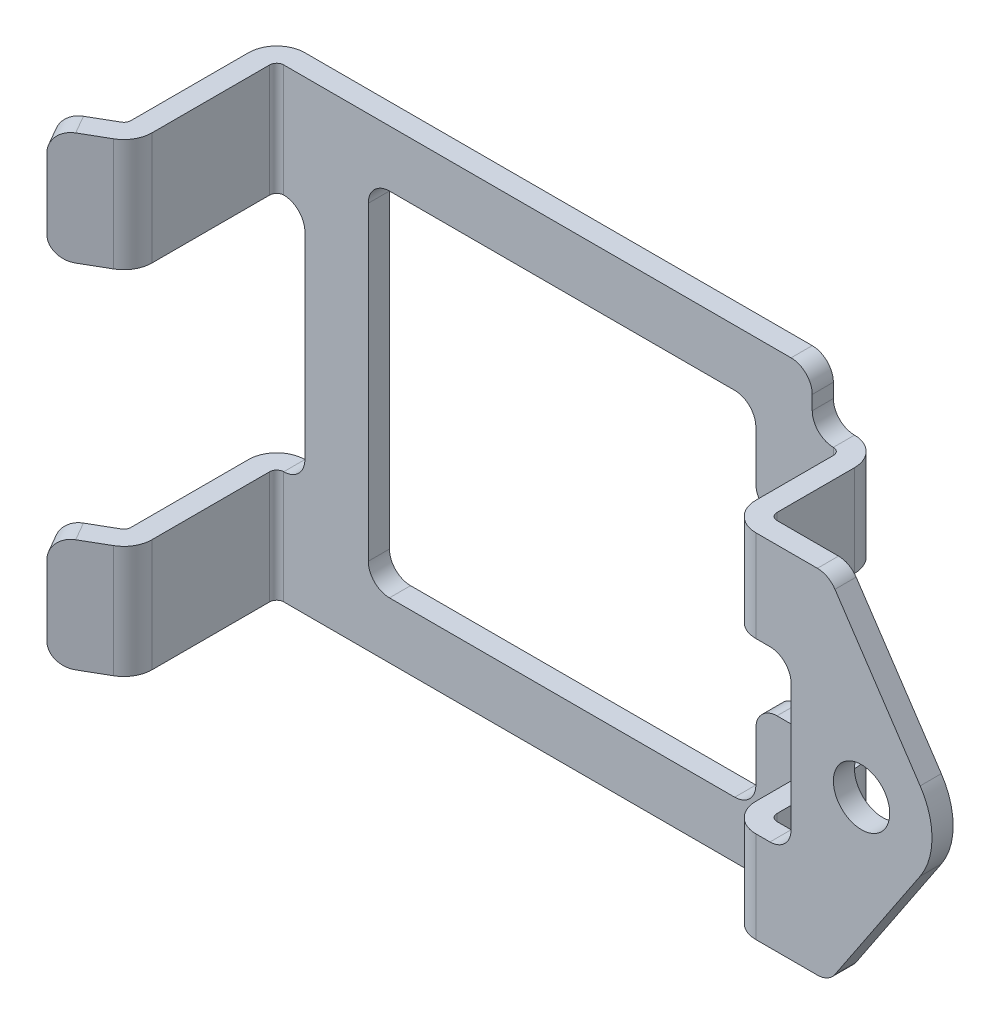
ISO-10303-21;
HEADER;
FILE_DESCRIPTION(('STEP AP214'),'2;1');
FILE_NAME('part.step','',(''),(''),'','','');
FILE_SCHEMA(('AUTOMOTIVE_DESIGN { 1 0 10303 214 1 1 1 1 }'));
ENDSEC;
DATA;
#1=APPLICATION_CONTEXT('core data for automotive mechanical design processes');
#2=APPLICATION_PROTOCOL_DEFINITION('international standard','automotive_design',2000,#1);
#3=PRODUCT_CONTEXT('',#1,'mechanical');
#4=PRODUCT('Part','Part','',(#3));
#5=PRODUCT_RELATED_PRODUCT_CATEGORY('part','',(#4));
#6=PRODUCT_DEFINITION_FORMATION('','',#4);
#7=PRODUCT_DEFINITION_CONTEXT('part definition',#1,'design');
#8=PRODUCT_DEFINITION('design','',#6,#7);
#9=PRODUCT_DEFINITION_SHAPE('','',#8);
#10=(LENGTH_UNIT() NAMED_UNIT(*) SI_UNIT(.MILLI.,.METRE.));
#11=(NAMED_UNIT(*) PLANE_ANGLE_UNIT() SI_UNIT($,.RADIAN.));
#12=(NAMED_UNIT(*) SI_UNIT($,.STERADIAN.) SOLID_ANGLE_UNIT());
#13=UNCERTAINTY_MEASURE_WITH_UNIT(LENGTH_MEASURE(1.E-05),#10,'distance_accuracy_value','');
#14=(GEOMETRIC_REPRESENTATION_CONTEXT(3) GLOBAL_UNCERTAINTY_ASSIGNED_CONTEXT((#13)) GLOBAL_UNIT_ASSIGNED_CONTEXT((#10,
#11,#12)) REPRESENTATION_CONTEXT('',''));
#15=CARTESIAN_POINT('',(0.,0.,0.));
#16=DIRECTION('',(0.,0.,1.));
#17=DIRECTION('',(1.,0.,0.));
#18=AXIS2_PLACEMENT_3D('',#15,#16,#17);
#19=CARTESIAN_POINT('',(29.5,1.75,-54.45));
#20=DIRECTION('',(0.,0.,-1.));
#21=DIRECTION('',(-1.,0.,0.));
#22=AXIS2_PLACEMENT_3D('',#19,#20,#21);
#23=CYLINDRICAL_SURFACE('',#22,2.);
#24=CARTESIAN_POINT('',(29.5,1.75,-54.6));
#25=DIRECTION('',(0.,0.,-1.));
#26=DIRECTION('',(-1.,0.,0.));
#27=AXIS2_PLACEMENT_3D('',#24,#25,#26);
#28=CIRCLE('',#27,2.);
#29=CARTESIAN_POINT('',(27.5,1.75,-54.6));
#30=VERTEX_POINT('',#29);
#31=EDGE_CURVE('E758',#30,#30,#28,.T.);
#32=ORIENTED_EDGE('',*,*,#31,.F.);
#33=EDGE_LOOP('',(#32));
#34=FACE_BOUND('',#33,.T.);
#35=CARTESIAN_POINT('',(29.5,1.75,-56.1));
#36=DIRECTION('',(0.,0.,-1.));
#37=DIRECTION('',(-1.,0.,0.));
#38=AXIS2_PLACEMENT_3D('',#35,#36,#37);
#39=CIRCLE('',#38,2.);
#40=CARTESIAN_POINT('',(27.5,1.75,-56.1));
#41=VERTEX_POINT('',#40);
#42=EDGE_CURVE('E495',#41,#41,#39,.F.);
#43=ORIENTED_EDGE('',*,*,#42,.F.);
#44=EDGE_LOOP('',(#43));
#45=FACE_BOUND('',#44,.T.);
#46=ADVANCED_FACE('F17',(#34,#45),#23,.F.);
#47=CARTESIAN_POINT('',(23.,6.25,-54.45));
#48=DIRECTION('',(0.,0.,-1.));
#49=DIRECTION('',(-1.,0.,0.));
#50=AXIS2_PLACEMENT_3D('',#47,#48,#49);
#51=CYLINDRICAL_SURFACE('',#50,1.50000000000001);
#52=DIRECTION('',(0.,0.,-1.));
#53=VECTOR('',#52,1.);
#54=CARTESIAN_POINT('',(23.,7.75,-54.45));
#55=LINE('',#54,#53);
#56=CARTESIAN_POINT('',(23.,7.75,-56.1));
#57=VERTEX_POINT('',#56);
#58=CARTESIAN_POINT('',(23.,7.75,-54.6));
#59=VERTEX_POINT('',#58);
#60=EDGE_CURVE('E455',#57,#59,#55,.F.);
#61=ORIENTED_EDGE('',*,*,#60,.F.);
#62=CARTESIAN_POINT('',(23.,6.25,-56.1));
#63=DIRECTION('',(0.,0.,-1.));
#64=DIRECTION('',(-1.,0.,0.));
#65=AXIS2_PLACEMENT_3D('',#62,#63,#64);
#66=CIRCLE('',#65,1.50000000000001);
#67=CARTESIAN_POINT('',(24.5,6.25,-56.1));
#68=VERTEX_POINT('',#67);
#69=EDGE_CURVE('E21',#68,#57,#66,.F.);
#70=ORIENTED_EDGE('',*,*,#69,.F.);
#71=DIRECTION('',(0.,0.,1.));
#72=VECTOR('',#71,1.);
#73=CARTESIAN_POINT('',(24.5,6.25,-54.6));
#74=LINE('',#73,#72);
#75=CARTESIAN_POINT('',(24.5,6.25,-54.6));
#76=VERTEX_POINT('',#75);
#77=EDGE_CURVE('E462',#76,#68,#74,.F.);
#78=ORIENTED_EDGE('',*,*,#77,.F.);
#79=CARTESIAN_POINT('',(23.,6.25,-54.6));
#80=DIRECTION('',(0.,0.,-1.));
#81=DIRECTION('',(-1.,0.,0.));
#82=AXIS2_PLACEMENT_3D('',#79,#80,#81);
#83=CIRCLE('',#82,1.50000000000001);
#84=EDGE_CURVE('E459',#59,#76,#83,.T.);
#85=ORIENTED_EDGE('',*,*,#84,.F.);
#86=EDGE_LOOP('',(#61,#70,#78,#85));
#87=FACE_BOUND('',#86,.T.);
#88=ADVANCED_FACE('F457',(#87),#51,.F.);
#89=CARTESIAN_POINT('',(24.5,6.25,-54.6));
#90=DIRECTION('',(-1.,0.,0.));
#91=DIRECTION('',(0.,0.,1.));
#92=AXIS2_PLACEMENT_3D('',#89,#90,#91);
#93=PLANE('',#92);
#94=DIRECTION('',(0.,0.,-1.));
#95=VECTOR('',#94,1.);
#96=CARTESIAN_POINT('',(24.5,-2.75,-54.45));
#97=LINE('',#96,#95);
#98=CARTESIAN_POINT('',(24.5,-2.75,-56.1));
#99=VERTEX_POINT('',#98);
#100=CARTESIAN_POINT('',(24.5,-2.75,-54.6));
#101=VERTEX_POINT('',#100);
#102=EDGE_CURVE('E491',#99,#101,#97,.F.);
#103=ORIENTED_EDGE('',*,*,#102,.T.);
#104=DIRECTION('',(0.,1.,0.));
#105=VECTOR('',#104,1.);
#106=CARTESIAN_POINT('',(24.5,14.25,-54.6));
#107=LINE('',#106,#105);
#108=EDGE_CURVE('E756',#76,#101,#107,.F.);
#109=ORIENTED_EDGE('',*,*,#108,.F.);
#110=ORIENTED_EDGE('',*,*,#77,.T.);
#111=DIRECTION('',(0.,1.,0.));
#112=VECTOR('',#111,1.);
#113=CARTESIAN_POINT('',(24.5,14.25,-56.1));
#114=LINE('',#113,#112);
#115=EDGE_CURVE('E477',#99,#68,#114,.T.);
#116=ORIENTED_EDGE('',*,*,#115,.F.);
#117=EDGE_LOOP('',(#103,#109,#110,#116));
#118=FACE_BOUND('',#117,.T.);
#119=ADVANCED_FACE('F1103',(#118),#93,.T.);
#120=CARTESIAN_POINT('',(23.,-2.74999999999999,-54.45));
#121=DIRECTION('',(0.,0.,-1.));
#122=DIRECTION('',(-1.,0.,0.));
#123=AXIS2_PLACEMENT_3D('',#120,#121,#122);
#124=CYLINDRICAL_SURFACE('',#123,1.50000000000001);
#125=ORIENTED_EDGE('',*,*,#102,.F.);
#126=CARTESIAN_POINT('',(23.,-2.74999999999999,-56.1));
#127=DIRECTION('',(0.,0.,-1.));
#128=DIRECTION('',(-1.,0.,0.));
#129=AXIS2_PLACEMENT_3D('',#126,#127,#128);
#130=CIRCLE('',#129,1.50000000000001);
#131=CARTESIAN_POINT('',(23.,-4.25,-56.1));
#132=VERTEX_POINT('',#131);
#133=EDGE_CURVE('E792',#132,#99,#130,.F.);
#134=ORIENTED_EDGE('',*,*,#133,.F.);
#135=DIRECTION('',(0.,0.,-1.));
#136=VECTOR('',#135,1.);
#137=CARTESIAN_POINT('',(23.,-4.25,-54.45));
#138=LINE('',#137,#136);
#139=CARTESIAN_POINT('',(23.,-4.25,-54.6));
#140=VERTEX_POINT('',#139);
#141=EDGE_CURVE('E497',#140,#132,#138,.T.);
#142=ORIENTED_EDGE('',*,*,#141,.F.);
#143=CARTESIAN_POINT('',(23.,-2.74999999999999,-54.6));
#144=DIRECTION('',(0.,0.,-1.));
#145=DIRECTION('',(-1.,0.,0.));
#146=AXIS2_PLACEMENT_3D('',#143,#144,#145);
#147=CIRCLE('',#146,1.50000000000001);
#148=EDGE_CURVE('E753',#101,#140,#147,.T.);
#149=ORIENTED_EDGE('',*,*,#148,.F.);
#150=EDGE_LOOP('',(#125,#134,#142,#149));
#151=FACE_BOUND('',#150,.T.);
#152=ADVANCED_FACE('F1101',(#151),#124,.F.);
#153=CARTESIAN_POINT('',(27.6147245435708,-10.0826324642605,-54.6));
#154=DIRECTION('',(0.831791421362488,-0.555088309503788,0.));
#155=DIRECTION('',(0.555088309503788,0.831791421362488,0.));
#156=AXIS2_PLACEMENT_3D('',#153,#154,#155);
#157=PLANE('',#156);
#158=DIRECTION('',(0.,0.,-1.));
#159=VECTOR('',#158,1.);
#160=CARTESIAN_POINT('',(33.658957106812,-1.02544154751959,-54.45));
#161=LINE('',#160,#159);
#162=CARTESIAN_POINT('',(33.6589571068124,-1.02544154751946,-54.6000000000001));
#163=VERTEX_POINT('',#162);
#164=CARTESIAN_POINT('',(33.6589571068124,-1.02544154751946,-56.1));
#165=VERTEX_POINT('',#164);
#166=EDGE_CURVE('E484',#163,#165,#161,.T.);
#167=ORIENTED_EDGE('',*,*,#166,.F.);
#168=DIRECTION('',(0.555088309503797,0.831791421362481,0.));
#169=VECTOR('',#168,1.);
#170=CARTESIAN_POINT('',(27.6147245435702,-10.0826324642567,-54.6));
#171=LINE('',#170,#169);
#172=CARTESIAN_POINT('',(27.614724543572,-10.0826324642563,-54.6));
#173=VERTEX_POINT('',#172);
#174=EDGE_CURVE('E748',#173,#163,#171,.T.);
#175=ORIENTED_EDGE('',*,*,#174,.F.);
#176=DIRECTION('',(0.,0.,1.));
#177=VECTOR('',#176,1.);
#178=CARTESIAN_POINT('',(27.6147245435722,-10.082632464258,-56.25));
#179=LINE('',#178,#177);
#180=CARTESIAN_POINT('',(27.614724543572,-10.0826324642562,-56.1));
#181=VERTEX_POINT('',#180);
#182=EDGE_CURVE('E492',#181,#173,#179,.T.);
#183=ORIENTED_EDGE('',*,*,#182,.F.);
#184=DIRECTION('',(-0.555088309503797,-0.831791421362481,0.));
#185=VECTOR('',#184,1.);
#186=CARTESIAN_POINT('',(33.6589571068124,-1.02544154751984,-56.1));
#187=LINE('',#186,#185);
#188=EDGE_CURVE('E797',#165,#181,#187,.T.);
#189=ORIENTED_EDGE('',*,*,#188,.F.);
#190=EDGE_LOOP('',(#167,#175,#183,#189));
#191=FACE_BOUND('',#190,.T.);
#192=ADVANCED_FACE('F1145',(#191),#157,.T.);
#193=CARTESIAN_POINT('',(29.4999999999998,1.75,-54.4499999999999));
#194=DIRECTION('',(0.,0.,-1.));
#195=DIRECTION('',(-1.,0.,0.));
#196=AXIS2_PLACEMENT_3D('',#193,#194,#195);
#197=CYLINDRICAL_SURFACE('',#196,5.0000000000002);
#198=CARTESIAN_POINT('',(29.4999999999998,1.75,-54.5999999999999));
#199=DIRECTION('',(0.,0.,-1.));
#200=DIRECTION('',(-1.,0.,0.));
#201=AXIS2_PLACEMENT_3D('',#198,#199,#200);
#202=CIRCLE('',#201,5.0000000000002);
#203=CARTESIAN_POINT('',(33.658957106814,4.52544154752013,-54.6));
#204=VERTEX_POINT('',#203);
#205=EDGE_CURVE('E745',#163,#204,#202,.F.);
#206=ORIENTED_EDGE('',*,*,#205,.F.);
#207=ORIENTED_EDGE('',*,*,#166,.T.);
#208=CARTESIAN_POINT('',(29.4999999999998,1.75000000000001,-56.0999999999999));
#209=DIRECTION('',(0.,0.,-1.));
#210=DIRECTION('',(-1.,0.,0.));
#211=AXIS2_PLACEMENT_3D('',#208,#209,#210);
#212=CIRCLE('',#211,5.0000000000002);
#213=CARTESIAN_POINT('',(33.658957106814,4.52544154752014,-56.1));
#214=VERTEX_POINT('',#213);
#215=EDGE_CURVE('E795',#214,#165,#212,.T.);
#216=ORIENTED_EDGE('',*,*,#215,.F.);
#217=DIRECTION('',(0.,0.,1.));
#218=VECTOR('',#217,1.);
#219=CARTESIAN_POINT('',(33.6589571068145,4.5254415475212,-54.6));
#220=LINE('',#219,#218);
#221=EDGE_CURVE('E479',#204,#214,#220,.F.);
#222=ORIENTED_EDGE('',*,*,#221,.F.);
#223=EDGE_LOOP('',(#206,#207,#216,#222));
#224=FACE_BOUND('',#223,.T.);
#225=ADVANCED_FACE('F1144',(#224),#197,.T.);
#226=CARTESIAN_POINT('',(33.6589571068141,4.52544154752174,-54.6));
#227=DIRECTION('',(0.831791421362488,0.555088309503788,0.));
#228=DIRECTION('',(-0.555088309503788,0.831791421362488,0.));
#229=AXIS2_PLACEMENT_3D('',#226,#227,#228);
#230=PLANE('',#229);
#231=DIRECTION('',(0.,0.,1.));
#232=VECTOR('',#231,1.);
#233=CARTESIAN_POINT('',(27.6147245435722,13.582632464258,-56.25));
#234=LINE('',#233,#232);
#235=CARTESIAN_POINT('',(27.6147245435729,13.5826324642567,-54.6));
#236=VERTEX_POINT('',#235);
#237=CARTESIAN_POINT('',(27.6147245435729,13.5826324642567,-56.1));
#238=VERTEX_POINT('',#237);
#239=EDGE_CURVE('E478',#236,#238,#234,.F.);
#240=ORIENTED_EDGE('',*,*,#239,.F.);
#241=DIRECTION('',(-0.555088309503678,0.83179142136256,0.));
#242=VECTOR('',#241,1.);
#243=CARTESIAN_POINT('',(33.6589571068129,4.52544154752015,-54.6));
#244=LINE('',#243,#242);
#245=EDGE_CURVE('E744',#204,#236,#244,.T.);
#246=ORIENTED_EDGE('',*,*,#245,.F.);
#247=ORIENTED_EDGE('',*,*,#221,.T.);
#248=DIRECTION('',(0.555088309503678,-0.831791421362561,0.));
#249=VECTOR('',#248,1.);
#250=CARTESIAN_POINT('',(27.614724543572,13.5826324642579,-56.1));
#251=LINE('',#250,#249);
#252=EDGE_CURVE('E798',#238,#214,#251,.T.);
#253=ORIENTED_EDGE('',*,*,#252,.F.);
#254=EDGE_LOOP('',(#240,#246,#247,#253));
#255=FACE_BOUND('',#254,.T.);
#256=ADVANCED_FACE('F1142',(#255),#230,.T.);
#257=CARTESIAN_POINT('',(26.36703741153,12.75,-56.25));
#258=DIRECTION('',(0.,0.,1.));
#259=DIRECTION('',(0.,-1.,0.));
#260=AXIS2_PLACEMENT_3D('',#257,#258,#259);
#261=CYLINDRICAL_SURFACE('',#260,1.49999999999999);
#262=ORIENTED_EDGE('',*,*,#239,.T.);
#263=CARTESIAN_POINT('',(26.36703741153,12.75,-56.1));
#264=DIRECTION('',(0.,0.,1.));
#265=DIRECTION('',(0.,-1.,0.));
#266=AXIS2_PLACEMENT_3D('',#263,#264,#265);
#267=CIRCLE('',#266,1.49999999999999);
#268=CARTESIAN_POINT('',(26.36703741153,14.25,-56.1));
#269=VERTEX_POINT('',#268);
#270=EDGE_CURVE('E471',#269,#238,#267,.F.);
#271=ORIENTED_EDGE('',*,*,#270,.F.);
#272=DIRECTION('',(0.,0.,1.));
#273=VECTOR('',#272,1.);
#274=CARTESIAN_POINT('',(26.36703741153,14.25,-64.112));
#275=LINE('',#274,#273);
#276=CARTESIAN_POINT('',(26.36703741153,14.25,-54.6));
#277=VERTEX_POINT('',#276);
#278=EDGE_CURVE('E487',#277,#269,#275,.F.);
#279=ORIENTED_EDGE('',*,*,#278,.F.);
#280=CARTESIAN_POINT('',(26.36703741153,12.7500000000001,-54.6));
#281=DIRECTION('',(0.,0.,1.));
#282=DIRECTION('',(0.,-1.,0.));
#283=AXIS2_PLACEMENT_3D('',#280,#281,#282);
#284=CIRCLE('',#283,1.49999999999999);
#285=EDGE_CURVE('E740',#236,#277,#284,.T.);
#286=ORIENTED_EDGE('',*,*,#285,.F.);
#287=EDGE_LOOP('',(#262,#271,#279,#286));
#288=FACE_BOUND('',#287,.T.);
#289=ADVANCED_FACE('F1138',(#288),#261,.T.);
#290=CARTESIAN_POINT('',(34.575,14.25,-56.1));
#291=DIRECTION('',(0.,0.,-1.));
#292=DIRECTION('',(-1.,0.,0.));
#293=AXIS2_PLACEMENT_3D('',#290,#291,#292);
#294=PLANE('',#293);
#295=ORIENTED_EDGE('',*,*,#42,.T.);
#296=EDGE_LOOP('',(#295));
#297=FACE_BOUND('',#296,.T.);
#298=ORIENTED_EDGE('',*,*,#133,.T.);
#299=ORIENTED_EDGE('',*,*,#115,.T.);
#300=ORIENTED_EDGE('',*,*,#69,.T.);
#301=DIRECTION('',(-1.,0.,0.));
#302=VECTOR('',#301,1.);
#303=CARTESIAN_POINT('',(34.575,7.75,-56.1));
#304=LINE('',#303,#302);
#305=CARTESIAN_POINT('',(22.,7.750000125,-56.1));
#306=VERTEX_POINT('',#305);
#307=EDGE_CURVE('E465',#57,#306,#304,.T.);
#308=ORIENTED_EDGE('',*,*,#307,.T.);
#309=DIRECTION('',(0.,1.,0.));
#310=VECTOR('',#309,1.);
#311=CARTESIAN_POINT('',(22.,7.1,-56.1));
#312=LINE('',#311,#310);
#313=CARTESIAN_POINT('',(22.,14.25,-56.1));
#314=VERTEX_POINT('',#313);
#315=EDGE_CURVE('E500',#306,#314,#312,.T.);
#316=ORIENTED_EDGE('',*,*,#315,.T.);
#317=DIRECTION('',(1.,0.,0.));
#318=VECTOR('',#317,1.);
#319=CARTESIAN_POINT('',(19.5,14.25,-56.1));
#320=LINE('',#319,#318);
#321=EDGE_CURVE('E784',#269,#314,#320,.F.);
#322=ORIENTED_EDGE('',*,*,#321,.F.);
#323=ORIENTED_EDGE('',*,*,#270,.T.);
#324=ORIENTED_EDGE('',*,*,#252,.T.);
#325=ORIENTED_EDGE('',*,*,#215,.T.);
#326=ORIENTED_EDGE('',*,*,#188,.T.);
#327=CARTESIAN_POINT('',(26.36703741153,-9.25000000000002,-56.1));
#328=DIRECTION('',(0.,0.,1.));
#329=DIRECTION('',(0.,-1.,0.));
#330=AXIS2_PLACEMENT_3D('',#327,#328,#329);
#331=CIRCLE('',#330,1.5);
#332=CARTESIAN_POINT('',(26.36703741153,-10.75,-56.1));
#333=VERTEX_POINT('',#332);
#334=EDGE_CURVE('E494',#333,#181,#331,.T.);
#335=ORIENTED_EDGE('',*,*,#334,.F.);
#336=DIRECTION('',(1.,0.,0.));
#337=VECTOR('',#336,1.);
#338=CARTESIAN_POINT('',(19.5,-10.75,-56.1));
#339=LINE('',#338,#337);
#340=CARTESIAN_POINT('',(22.,-10.749999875,-56.1));
#341=VERTEX_POINT('',#340);
#342=EDGE_CURVE('E732',#341,#333,#339,.T.);
#343=ORIENTED_EDGE('',*,*,#342,.F.);
#344=DIRECTION('',(0.,1.,0.));
#345=VECTOR('',#344,1.);
#346=CARTESIAN_POINT('',(22.,-11.4,-56.1));
#347=LINE('',#346,#345);
#348=CARTESIAN_POINT('',(22.,-4.25,-56.1));
#349=VERTEX_POINT('',#348);
#350=EDGE_CURVE('E739',#341,#349,#347,.T.);
#351=ORIENTED_EDGE('',*,*,#350,.T.);
#352=DIRECTION('',(-1.,0.,0.));
#353=VECTOR('',#352,1.);
#354=CARTESIAN_POINT('',(34.575,-4.25,-56.1));
#355=LINE('',#354,#353);
#356=EDGE_CURVE('E794',#349,#132,#355,.F.);
#357=ORIENTED_EDGE('',*,*,#356,.T.);
#358=EDGE_LOOP('',(#298,#299,#300,#308,#316,#322,#323,#324,#325,#326,#335,#343,#351,#357));
#359=FACE_BOUND('',#358,.T.);
#360=ADVANCED_FACE('F475',(#297,#359),#294,.T.);
#361=CARTESIAN_POINT('',(26.36703741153,-9.25000000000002,-56.25));
#362=DIRECTION('',(0.,0.,1.));
#363=DIRECTION('',(0.,-1.,0.));
#364=AXIS2_PLACEMENT_3D('',#361,#362,#363);
#365=CYLINDRICAL_SURFACE('',#364,1.5);
#366=DIRECTION('',(0.,0.,-1.));
#367=VECTOR('',#366,1.);
#368=CARTESIAN_POINT('',(26.36703741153,-10.75,-64.112));
#369=LINE('',#368,#367);
#370=CARTESIAN_POINT('',(26.36703741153,-10.75,-54.6));
#371=VERTEX_POINT('',#370);
#372=EDGE_CURVE('E826',#333,#371,#369,.F.);
#373=ORIENTED_EDGE('',*,*,#372,.F.);
#374=ORIENTED_EDGE('',*,*,#334,.T.);
#375=ORIENTED_EDGE('',*,*,#182,.T.);
#376=CARTESIAN_POINT('',(26.36703741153,-9.25000000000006,-54.6));
#377=DIRECTION('',(0.,0.,1.));
#378=DIRECTION('',(0.,-1.,0.));
#379=AXIS2_PLACEMENT_3D('',#376,#377,#378);
#380=CIRCLE('',#379,1.5);
#381=EDGE_CURVE('E749',#371,#173,#380,.T.);
#382=ORIENTED_EDGE('',*,*,#381,.F.);
#383=EDGE_LOOP('',(#373,#374,#375,#382));
#384=FACE_BOUND('',#383,.T.);
#385=ADVANCED_FACE('F1060',(#384),#365,.T.);
#386=CARTESIAN_POINT('',(22.,7.1,-56.6));
#387=DIRECTION('',(0.,1.,0.));
#388=DIRECTION('',(-1.,0.,0.));
#389=AXIS2_PLACEMENT_3D('',#386,#387,#388);
#390=CYLINDRICAL_SURFACE('',#389,0.499999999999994);
#391=CARTESIAN_POINT('',(22.,7.75000025,-56.6));
#392=DIRECTION('',(0.,1.,0.));
#393=DIRECTION('',(-1.,0.,0.));
#394=AXIS2_PLACEMENT_3D('',#391,#392,#393);
#395=CIRCLE('',#394,0.499999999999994);
#396=CARTESIAN_POINT('',(21.4999998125,7.750000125,-56.600000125));
#397=VERTEX_POINT('',#396);
#398=EDGE_CURVE('E468',#397,#306,#395,.T.);
#399=ORIENTED_EDGE('',*,*,#398,.F.);
#400=DIRECTION('',(0.,1.,0.));
#401=VECTOR('',#400,1.);
#402=CARTESIAN_POINT('',(21.5,14.25,-56.60000025));
#403=LINE('',#402,#401);
#404=CARTESIAN_POINT('',(21.5,14.25,-56.600000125));
#405=VERTEX_POINT('',#404);
#406=EDGE_CURVE('E722',#405,#397,#403,.F.);
#407=ORIENTED_EDGE('',*,*,#406,.F.);
#408=CARTESIAN_POINT('',(22.,14.25,-56.6));
#409=DIRECTION('',(0.,1.,0.));
#410=DIRECTION('',(-1.,0.,0.));
#411=AXIS2_PLACEMENT_3D('',#408,#409,#410);
#412=CIRCLE('',#411,0.499999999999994);
#413=EDGE_CURVE('E781',#314,#405,#412,.F.);
#414=ORIENTED_EDGE('',*,*,#413,.F.);
#415=ORIENTED_EDGE('',*,*,#315,.F.);
#416=EDGE_LOOP('',(#399,#407,#414,#415));
#417=FACE_BOUND('',#416,.T.);
#418=ADVANCED_FACE('F1133',(#417),#390,.F.);
#419=CARTESIAN_POINT('',(19.5,14.25,-64.112));
#420=DIRECTION('',(0.,1.,0.));
#421=DIRECTION('',(0.,0.,1.));
#422=AXIS2_PLACEMENT_3D('',#419,#420,#421);
#423=PLANE('',#422);
#424=ORIENTED_EDGE('',*,*,#413,.T.);
#425=DIRECTION('',(0.,0.,-1.));
#426=VECTOR('',#425,1.);
#427=CARTESIAN_POINT('',(21.5,14.25,-56.6));
#428=LINE('',#427,#426);
#429=CARTESIAN_POINT('',(21.5,14.25,-62.1));
#430=VERTEX_POINT('',#429);
#431=EDGE_CURVE('E1014',#430,#405,#428,.F.);
#432=ORIENTED_EDGE('',*,*,#431,.F.);
#433=CARTESIAN_POINT('',(19.5,14.25,-62.1));
#434=DIRECTION('',(0.,1.,0.));
#435=DIRECTION('',(0.,0.,1.));
#436=AXIS2_PLACEMENT_3D('',#433,#434,#435);
#437=CIRCLE('',#436,1.99999999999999);
#438=CARTESIAN_POINT('',(19.5,14.25,-64.1));
#439=VERTEX_POINT('',#438);
#440=EDGE_CURVE('E726',#439,#430,#437,.F.);
#441=ORIENTED_EDGE('',*,*,#440,.F.);
#442=DIRECTION('',(0.,0.,1.));
#443=VECTOR('',#442,1.);
#444=CARTESIAN_POINT('',(19.5,14.25,-64.112));
#445=LINE('',#444,#443);
#446=CARTESIAN_POINT('',(19.5,14.25,-62.6));
#447=VERTEX_POINT('',#446);
#448=EDGE_CURVE('E501',#439,#447,#445,.T.);
#449=ORIENTED_EDGE('',*,*,#448,.T.);
#450=CARTESIAN_POINT('',(19.5,14.25,-62.1));
#451=DIRECTION('',(0.,1.,0.));
#452=DIRECTION('',(0.,0.,1.));
#453=AXIS2_PLACEMENT_3D('',#450,#451,#452);
#454=CIRCLE('',#453,0.5);
#455=CARTESIAN_POINT('',(20.,14.25,-62.1));
#456=VERTEX_POINT('',#455);
#457=EDGE_CURVE('E785',#447,#456,#454,.F.);
#458=ORIENTED_EDGE('',*,*,#457,.T.);
#459=DIRECTION('',(0.,0.,1.));
#460=VECTOR('',#459,1.);
#461=CARTESIAN_POINT('',(20.,14.25,-56.6));
#462=LINE('',#461,#460);
#463=CARTESIAN_POINT('',(20.,14.25,-56.6));
#464=VERTEX_POINT('',#463);
#465=EDGE_CURVE('E717',#464,#456,#462,.F.);
#466=ORIENTED_EDGE('',*,*,#465,.F.);
#467=CARTESIAN_POINT('',(22.,14.25,-56.6));
#468=DIRECTION('',(0.,1.,0.));
#469=DIRECTION('',(-1.,0.,0.));
#470=AXIS2_PLACEMENT_3D('',#467,#468,#469);
#471=CIRCLE('',#470,1.99999999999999);
#472=CARTESIAN_POINT('',(22.,14.25,-54.6));
#473=VERTEX_POINT('',#472);
#474=EDGE_CURVE('E718',#473,#464,#471,.F.);
#475=ORIENTED_EDGE('',*,*,#474,.F.);
#476=DIRECTION('',(1.,0.,0.));
#477=VECTOR('',#476,1.);
#478=CARTESIAN_POINT('',(34.575,14.25,-54.6));
#479=LINE('',#478,#477);
#480=EDGE_CURVE('E743',#277,#473,#479,.F.);
#481=ORIENTED_EDGE('',*,*,#480,.F.);
#482=ORIENTED_EDGE('',*,*,#278,.T.);
#483=ORIENTED_EDGE('',*,*,#321,.T.);
#484=EDGE_LOOP('',(#424,#432,#441,#449,#458,#466,#475,#481,#482,#483));
#485=FACE_BOUND('',#484,.T.);
#486=ADVANCED_FACE('F1135',(#485),#423,.T.);
#487=CARTESIAN_POINT('',(-22.,9.45,-53.7547005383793));
#488=DIRECTION('',(0.,1.,0.));
#489=DIRECTION('',(0.,0.,1.));
#490=AXIS2_PLACEMENT_3D('',#487,#488,#489);
#491=CYLINDRICAL_SURFACE('',#490,0.499999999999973);
#492=CARTESIAN_POINT('',(-22.,10.25,-53.7547005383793));
#493=DIRECTION('',(0.,1.,0.));
#494=DIRECTION('',(0.,0.,1.));
#495=AXIS2_PLACEMENT_3D('',#492,#493,#494);
#496=CIRCLE('',#495,0.499999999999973);
#497=CARTESIAN_POINT('',(-21.75,10.25,-53.321687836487));
#498=VERTEX_POINT('',#497);
#499=CARTESIAN_POINT('',(-21.5,10.25,-53.7547006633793));
#500=VERTEX_POINT('',#499);
#501=EDGE_CURVE('E771',#498,#500,#496,.T.);
#502=ORIENTED_EDGE('',*,*,#501,.F.);
#503=DIRECTION('',(0.,1.,0.));
#504=VECTOR('',#503,1.);
#505=CARTESIAN_POINT('',(-21.75,18.25,-53.321687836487));
#506=LINE('',#505,#504);
#507=CARTESIAN_POINT('',(-21.7499999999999,18.249999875,-53.3216878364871));
#508=VERTEX_POINT('',#507);
#509=EDGE_CURVE('E705',#508,#498,#506,.F.);
#510=ORIENTED_EDGE('',*,*,#509,.F.);
#511=CARTESIAN_POINT('',(-22.,18.24999975,-53.7547005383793));
#512=DIRECTION('',(0.,1.,0.));
#513=DIRECTION('',(0.,0.,1.));
#514=AXIS2_PLACEMENT_3D('',#511,#512,#513);
#515=CIRCLE('',#514,0.499999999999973);
#516=CARTESIAN_POINT('',(-21.4999998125,18.249999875,-53.7547006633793));
#517=VERTEX_POINT('',#516);
#518=EDGE_CURVE('E778',#517,#508,#515,.F.);
#519=ORIENTED_EDGE('',*,*,#518,.F.);
#520=DIRECTION('',(0.,1.,0.));
#521=VECTOR('',#520,1.);
#522=CARTESIAN_POINT('',(-21.5,18.25,-53.7547007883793));
#523=LINE('',#522,#521);
#524=EDGE_CURVE('E834',#500,#517,#523,.T.);
#525=ORIENTED_EDGE('',*,*,#524,.F.);
#526=EDGE_LOOP('',(#502,#510,#519,#525));
#527=FACE_BOUND('',#526,.T.);
#528=ADVANCED_FACE('F1232',(#527),#491,.F.);
#529=CARTESIAN_POINT('',(-24.0000000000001,16.75,-50.2905989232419));
#530=DIRECTION('',(-0.866025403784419,0.,0.500000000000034));
#531=DIRECTION('',(0.500000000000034,0.,0.866025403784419));
#532=AXIS2_PLACEMENT_3D('',#529,#530,#531);
#533=PLANE('',#532);
#534=DIRECTION('',(0.500000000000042,0.,0.866025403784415));
#535=VECTOR('',#534,1.);
#536=CARTESIAN_POINT('',(-24.8250000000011,11.75,-51.7195408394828));
#537=LINE('',#536,#535);
#538=CARTESIAN_POINT('',(-24.0000000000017,11.75,-50.290598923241));
#539=VERTEX_POINT('',#538);
#540=CARTESIAN_POINT('',(-24.7500000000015,11.75,-51.5896370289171));
#541=VERTEX_POINT('',#540);
#542=EDGE_CURVE('E780',#539,#541,#537,.F.);
#543=ORIENTED_EDGE('',*,*,#542,.F.);
#544=DIRECTION('',(0.,1.,0.));
#545=VECTOR('',#544,1.);
#546=CARTESIAN_POINT('',(-24.0000000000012,18.25,-50.2905989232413));
#547=LINE('',#546,#545);
#548=CARTESIAN_POINT('',(-24.0000000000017,16.75,-50.290598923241));
#549=VERTEX_POINT('',#548);
#550=EDGE_CURVE('E701',#549,#539,#547,.F.);
#551=ORIENTED_EDGE('',*,*,#550,.F.);
#552=DIRECTION('',(0.500000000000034,0.,0.866025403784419));
#553=VECTOR('',#552,1.);
#554=CARTESIAN_POINT('',(-24.8250000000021,16.75,-51.7195408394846));
#555=LINE('',#554,#553);
#556=CARTESIAN_POINT('',(-24.7500000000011,16.75,-51.5896370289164));
#557=VERTEX_POINT('',#556);
#558=EDGE_CURVE('E1028',#557,#549,#555,.T.);
#559=ORIENTED_EDGE('',*,*,#558,.F.);
#560=DIRECTION('',(0.,1.,0.));
#561=VECTOR('',#560,1.);
#562=CARTESIAN_POINT('',(-24.750000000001,18.25,-51.5896370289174));
#563=LINE('',#562,#561);
#564=EDGE_CURVE('E706',#541,#557,#563,.T.);
#565=ORIENTED_EDGE('',*,*,#564,.F.);
#566=EDGE_LOOP('',(#543,#551,#559,#565));
#567=FACE_BOUND('',#566,.T.);
#568=ADVANCED_FACE('F1240',(#567),#533,.T.);
#569=CARTESIAN_POINT('',(-23.5259618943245,11.75,-52.4695408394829));
#570=DIRECTION('',(0.500000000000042,0.,0.866025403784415));
#571=DIRECTION('',(0.866025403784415,0.,-0.500000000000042));
#572=AXIS2_PLACEMENT_3D('',#569,#570,#571);
#573=CYLINDRICAL_SURFACE('',#572,1.49999999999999);
#574=ORIENTED_EDGE('',*,*,#542,.T.);
#575=CARTESIAN_POINT('',(-23.4509618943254,11.75,-52.3396370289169));
#576=DIRECTION('',(0.500000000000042,0.,0.866025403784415));
#577=DIRECTION('',(0.866025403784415,0.,-0.500000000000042));
#578=AXIS2_PLACEMENT_3D('',#575,#576,#577);
#579=CIRCLE('',#578,1.49999999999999);
#580=CARTESIAN_POINT('',(-23.4509618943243,10.25,-52.3396370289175));
#581=VERTEX_POINT('',#580);
#582=EDGE_CURVE('E707',#581,#541,#579,.F.);
#583=ORIENTED_EDGE('',*,*,#582,.F.);
#584=DIRECTION('',(-0.500000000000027,0.,-0.866025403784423));
#585=VECTOR('',#584,1.);
#586=CARTESIAN_POINT('',(-22.7009618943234,10.25,-51.040598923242));
#587=LINE('',#586,#585);
#588=CARTESIAN_POINT('',(-22.7009618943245,10.25,-51.0405989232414));
#589=VERTEX_POINT('',#588);
#590=EDGE_CURVE('E774',#589,#581,#587,.T.);
#591=ORIENTED_EDGE('',*,*,#590,.F.);
#592=CARTESIAN_POINT('',(-22.7009618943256,11.75,-51.0405989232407));
#593=DIRECTION('',(0.500000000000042,0.,0.866025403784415));
#594=DIRECTION('',(0.866025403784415,0.,-0.500000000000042));
#595=AXIS2_PLACEMENT_3D('',#592,#593,#594);
#596=CIRCLE('',#595,1.49999999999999);
#597=EDGE_CURVE('E698',#539,#589,#596,.T.);
#598=ORIENTED_EDGE('',*,*,#597,.F.);
#599=EDGE_LOOP('',(#574,#583,#591,#598));
#600=FACE_BOUND('',#599,.T.);
#601=ADVANCED_FACE('F1224',(#600),#573,.T.);
#602=CARTESIAN_POINT('',(-23.5259618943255,16.75,-52.4695408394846));
#603=DIRECTION('',(0.500000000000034,0.,0.866025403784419));
#604=DIRECTION('',(0.866025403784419,0.,-0.500000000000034));
#605=AXIS2_PLACEMENT_3D('',#602,#603,#604);
#606=CYLINDRICAL_SURFACE('',#605,1.49999999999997);
#607=DIRECTION('',(0.500000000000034,0.,0.866025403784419));
#608=VECTOR('',#607,1.);
#609=CARTESIAN_POINT('',(-23.5259618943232,18.25,-52.4695408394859));
#610=LINE('',#609,#608);
#611=CARTESIAN_POINT('',(-22.7009618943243,18.25,-51.040598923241));
#612=VERTEX_POINT('',#611);
#613=CARTESIAN_POINT('',(-23.4509618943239,18.25,-52.3396370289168));
#614=VERTEX_POINT('',#613);
#615=EDGE_CURVE('E812',#612,#614,#610,.F.);
#616=ORIENTED_EDGE('',*,*,#615,.T.);
#617=CARTESIAN_POINT('',(-23.450961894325,16.75,-52.3396370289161));
#618=DIRECTION('',(0.500000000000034,0.,0.866025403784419));
#619=DIRECTION('',(0.866025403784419,0.,-0.500000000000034));
#620=AXIS2_PLACEMENT_3D('',#617,#618,#619);
#621=CIRCLE('',#620,1.49999999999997);
#622=EDGE_CURVE('E702',#557,#614,#621,.F.);
#623=ORIENTED_EDGE('',*,*,#622,.F.);
#624=ORIENTED_EDGE('',*,*,#558,.T.);
#625=CARTESIAN_POINT('',(-22.7009618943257,16.75,-51.0405989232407));
#626=DIRECTION('',(0.500000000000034,0.,0.866025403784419));
#627=DIRECTION('',(0.866025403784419,0.,-0.500000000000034));
#628=AXIS2_PLACEMENT_3D('',#625,#626,#627);
#629=CIRCLE('',#628,1.49999999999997);
#630=EDGE_CURVE('E694',#612,#549,#629,.T.);
#631=ORIENTED_EDGE('',*,*,#630,.F.);
#632=EDGE_LOOP('',(#616,#623,#624,#631));
#633=FACE_BOUND('',#632,.T.);
#634=ADVANCED_FACE('F1237',(#633),#606,.T.);
#635=CARTESIAN_POINT('',(-21.512,10.25,-62.1));
#636=DIRECTION('',(0.,-1.,0.));
#637=DIRECTION('',(0.,0.,-1.));
#638=AXIS2_PLACEMENT_3D('',#635,#636,#637);
#639=PLANE('',#638);
#640=ORIENTED_EDGE('',*,*,#501,.T.);
#641=DIRECTION('',(0.,0.,1.));
#642=VECTOR('',#641,1.);
#643=CARTESIAN_POINT('',(-21.5,10.25,-62.1));
#644=LINE('',#643,#642);
#645=CARTESIAN_POINT('',(-21.5,10.25,-62.1));
#646=VERTEX_POINT('',#645);
#647=EDGE_CURVE('E1006',#646,#500,#644,.T.);
#648=ORIENTED_EDGE('',*,*,#647,.F.);
#649=CARTESIAN_POINT('',(-19.5,10.25,-62.1));
#650=DIRECTION('',(0.,1.,0.));
#651=DIRECTION('',(0.,0.,1.));
#652=AXIS2_PLACEMENT_3D('',#649,#650,#651);
#653=CIRCLE('',#652,1.99999999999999);
#654=CARTESIAN_POINT('',(-19.5,10.25,-64.1));
#655=VERTEX_POINT('',#654);
#656=EDGE_CURVE('E711',#655,#646,#653,.T.);
#657=ORIENTED_EDGE('',*,*,#656,.F.);
#658=DIRECTION('',(0.,0.,-1.));
#659=VECTOR('',#658,1.);
#660=CARTESIAN_POINT('',(-19.5,10.25,-62.1));
#661=LINE('',#660,#659);
#662=CARTESIAN_POINT('',(-19.5,10.25,-62.6));
#663=VERTEX_POINT('',#662);
#664=EDGE_CURVE('E777',#655,#663,#661,.F.);
#665=ORIENTED_EDGE('',*,*,#664,.T.);
#666=CARTESIAN_POINT('',(-19.5,10.25,-62.1));
#667=DIRECTION('',(0.,1.,0.));
#668=DIRECTION('',(0.,0.,1.));
#669=AXIS2_PLACEMENT_3D('',#666,#667,#668);
#670=CIRCLE('',#669,0.5);
#671=CARTESIAN_POINT('',(-20.,10.25,-62.1));
#672=VERTEX_POINT('',#671);
#673=EDGE_CURVE('E775',#663,#672,#670,.T.);
#674=ORIENTED_EDGE('',*,*,#673,.T.);
#675=DIRECTION('',(0.,0.,-1.));
#676=VECTOR('',#675,1.);
#677=CARTESIAN_POINT('',(-20.,10.25,-62.1));
#678=LINE('',#677,#676);
#679=CARTESIAN_POINT('',(-20.,10.25,-53.7547005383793));
#680=VERTEX_POINT('',#679);
#681=EDGE_CURVE('E842',#680,#672,#678,.T.);
#682=ORIENTED_EDGE('',*,*,#681,.F.);
#683=CARTESIAN_POINT('',(-22.,10.25,-53.7547005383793));
#684=DIRECTION('',(0.,1.,0.));
#685=DIRECTION('',(0.,0.,1.));
#686=AXIS2_PLACEMENT_3D('',#683,#684,#685);
#687=CIRCLE('',#686,1.99999999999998);
#688=CARTESIAN_POINT('',(-21.0000000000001,10.25,-52.0226497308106));
#689=VERTEX_POINT('',#688);
#690=EDGE_CURVE('E690',#689,#680,#687,.T.);
#691=ORIENTED_EDGE('',*,*,#690,.F.);
#692=DIRECTION('',(0.866025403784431,0.,-0.500000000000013));
#693=VECTOR('',#692,1.);
#694=CARTESIAN_POINT('',(-21.0000000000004,10.25,-52.0226497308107));
#695=LINE('',#694,#693);
#696=EDGE_CURVE('E697',#589,#689,#695,.T.);
#697=ORIENTED_EDGE('',*,*,#696,.F.);
#698=ORIENTED_EDGE('',*,*,#590,.T.);
#699=DIRECTION('',(-0.866025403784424,0.,0.500000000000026));
#700=VECTOR('',#699,1.);
#701=CARTESIAN_POINT('',(-21.75,10.25,-53.321687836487));
#702=LINE('',#701,#700);
#703=EDGE_CURVE('E710',#498,#581,#702,.T.);
#704=ORIENTED_EDGE('',*,*,#703,.F.);
#705=EDGE_LOOP('',(#640,#648,#657,#665,#674,#682,#691,#697,#698,#704));
#706=FACE_BOUND('',#705,.T.);
#707=ADVANCED_FACE('F1185',(#706),#639,.T.);
#708=CARTESIAN_POINT('',(-23.5259618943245,-13.25,-52.4695408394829));
#709=DIRECTION('',(0.500000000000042,0.,0.866025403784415));
#710=DIRECTION('',(0.866025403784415,0.,-0.500000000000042));
#711=AXIS2_PLACEMENT_3D('',#708,#709,#710);
#712=CYLINDRICAL_SURFACE('',#711,1.5);
#713=DIRECTION('',(0.500000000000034,0.,0.866025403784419));
#714=VECTOR('',#713,1.);
#715=CARTESIAN_POINT('',(-24.0000000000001,-13.25,-50.2905989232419));
#716=LINE('',#715,#714);
#717=CARTESIAN_POINT('',(-24.7500000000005,-13.25,-51.5896370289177));
#718=VERTEX_POINT('',#717);
#719=CARTESIAN_POINT('',(-24.0000000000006,-13.25,-50.2905989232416));
#720=VERTEX_POINT('',#719);
#721=EDGE_CURVE('E1023',#718,#720,#716,.T.);
#722=ORIENTED_EDGE('',*,*,#721,.F.);
#723=CARTESIAN_POINT('',(-23.4509618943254,-13.25,-52.3396370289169));
#724=DIRECTION('',(0.500000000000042,0.,0.866025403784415));
#725=DIRECTION('',(0.866025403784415,0.,-0.500000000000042));
#726=AXIS2_PLACEMENT_3D('',#723,#724,#725);
#727=CIRCLE('',#726,1.5);
#728=CARTESIAN_POINT('',(-23.4509618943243,-14.75,-52.3396370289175));
#729=VERTEX_POINT('',#728);
#730=EDGE_CURVE('E679',#729,#718,#727,.F.);
#731=ORIENTED_EDGE('',*,*,#730,.F.);
#732=DIRECTION('',(0.500000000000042,0.,0.866025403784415));
#733=VECTOR('',#732,1.);
#734=CARTESIAN_POINT('',(-23.5259618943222,-14.75,-52.4695408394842));
#735=LINE('',#734,#733);
#736=CARTESIAN_POINT('',(-22.7009618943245,-14.75,-51.0405989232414));
#737=VERTEX_POINT('',#736);
#738=EDGE_CURVE('E773',#729,#737,#735,.T.);
#739=ORIENTED_EDGE('',*,*,#738,.T.);
#740=CARTESIAN_POINT('',(-22.7009618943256,-13.25,-51.0405989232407));
#741=DIRECTION('',(0.500000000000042,0.,0.866025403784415));
#742=DIRECTION('',(0.866025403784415,0.,-0.500000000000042));
#743=AXIS2_PLACEMENT_3D('',#740,#741,#742);
#744=CIRCLE('',#743,1.5);
#745=EDGE_CURVE('E686',#720,#737,#744,.T.);
#746=ORIENTED_EDGE('',*,*,#745,.F.);
#747=EDGE_LOOP('',(#722,#731,#739,#746));
#748=FACE_BOUND('',#747,.T.);
#749=ADVANCED_FACE('F1406',(#748),#712,.T.);
#750=CARTESIAN_POINT('',(-24.0000000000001,-8.25,-50.2905989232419));
#751=DIRECTION('',(-0.866025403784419,0.,0.500000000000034));
#752=DIRECTION('',(0.500000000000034,0.,0.866025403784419));
#753=AXIS2_PLACEMENT_3D('',#750,#751,#752);
#754=PLANE('',#753);
#755=ORIENTED_EDGE('',*,*,#721,.T.);
#756=DIRECTION('',(0.,1.,0.));
#757=VECTOR('',#756,1.);
#758=CARTESIAN_POINT('',(-24.0000000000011,-6.75,-50.2905989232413));
#759=LINE('',#758,#757);
#760=CARTESIAN_POINT('',(-24.0000000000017,-8.25000000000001,-50.290598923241));
#761=VERTEX_POINT('',#760);
#762=EDGE_CURVE('E689',#761,#720,#759,.F.);
#763=ORIENTED_EDGE('',*,*,#762,.F.);
#764=DIRECTION('',(0.500000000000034,0.,0.866025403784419));
#765=VECTOR('',#764,1.);
#766=CARTESIAN_POINT('',(-24.8250000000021,-8.25,-51.7195408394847));
#767=LINE('',#766,#765);
#768=CARTESIAN_POINT('',(-24.7500000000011,-8.25,-51.5896370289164));
#769=VERTEX_POINT('',#768);
#770=EDGE_CURVE('E770',#769,#761,#767,.T.);
#771=ORIENTED_EDGE('',*,*,#770,.F.);
#772=DIRECTION('',(0.,1.,0.));
#773=VECTOR('',#772,1.);
#774=CARTESIAN_POINT('',(-24.750000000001,-6.75,-51.5896370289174));
#775=LINE('',#774,#773);
#776=EDGE_CURVE('E678',#718,#769,#775,.T.);
#777=ORIENTED_EDGE('',*,*,#776,.F.);
#778=EDGE_LOOP('',(#755,#763,#771,#777));
#779=FACE_BOUND('',#778,.T.);
#780=ADVANCED_FACE('F1402',(#779),#754,.T.);
#781=CARTESIAN_POINT('',(-23.5259618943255,-8.25,-52.4695408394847));
#782=DIRECTION('',(0.500000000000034,0.,0.866025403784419));
#783=DIRECTION('',(0.866025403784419,0.,-0.500000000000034));
#784=AXIS2_PLACEMENT_3D('',#781,#782,#783);
#785=CYLINDRICAL_SURFACE('',#784,1.49999999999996);
#786=DIRECTION('',(0.500000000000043,0.,0.866025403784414));
#787=VECTOR('',#786,1.);
#788=CARTESIAN_POINT('',(-23.4509618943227,-6.75,-52.3396370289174));
#789=LINE('',#788,#787);
#790=CARTESIAN_POINT('',(-23.4509618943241,-6.75,-52.3396370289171));
#791=VERTEX_POINT('',#790);
#792=CARTESIAN_POINT('',(-22.7009618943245,-6.75,-51.0405989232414));
#793=VERTEX_POINT('',#792);
#794=EDGE_CURVE('E761',#791,#793,#789,.T.);
#795=ORIENTED_EDGE('',*,*,#794,.F.);
#796=CARTESIAN_POINT('',(-23.450961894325,-8.25,-52.3396370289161));
#797=DIRECTION('',(0.500000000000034,0.,0.866025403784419));
#798=DIRECTION('',(0.866025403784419,0.,-0.500000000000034));
#799=AXIS2_PLACEMENT_3D('',#796,#797,#798);
#800=CIRCLE('',#799,1.49999999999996);
#801=EDGE_CURVE('E674',#769,#791,#800,.F.);
#802=ORIENTED_EDGE('',*,*,#801,.F.);
#803=ORIENTED_EDGE('',*,*,#770,.T.);
#804=CARTESIAN_POINT('',(-22.7009618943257,-8.25000000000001,-51.0405989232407));
#805=DIRECTION('',(0.500000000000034,0.,0.866025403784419));
#806=DIRECTION('',(0.866025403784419,0.,-0.500000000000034));
#807=AXIS2_PLACEMENT_3D('',#804,#805,#806);
#808=CIRCLE('',#807,1.49999999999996);
#809=EDGE_CURVE('E682',#793,#761,#808,.T.);
#810=ORIENTED_EDGE('',*,*,#809,.F.);
#811=EDGE_LOOP('',(#795,#802,#803,#810));
#812=FACE_BOUND('',#811,.T.);
#813=ADVANCED_FACE('F1398',(#812),#785,.T.);
#814=CARTESIAN_POINT('',(-22.,-15.55,-53.7547005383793));
#815=DIRECTION('',(0.,1.,0.));
#816=DIRECTION('',(-1.,0.,0.));
#817=AXIS2_PLACEMENT_3D('',#814,#815,#816);
#818=CYLINDRICAL_SURFACE('',#817,0.499999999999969);
#819=DIRECTION('',(0.,1.,0.));
#820=VECTOR('',#819,1.);
#821=CARTESIAN_POINT('',(-21.7500000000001,-6.75,-53.321687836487));
#822=LINE('',#821,#820);
#823=CARTESIAN_POINT('',(-21.75,-6.75,-53.321687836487));
#824=VERTEX_POINT('',#823);
#825=CARTESIAN_POINT('',(-21.75,-14.75,-53.321687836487));
#826=VERTEX_POINT('',#825);
#827=EDGE_CURVE('E845',#824,#826,#822,.F.);
#828=ORIENTED_EDGE('',*,*,#827,.F.);
#829=CARTESIAN_POINT('',(-21.9999999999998,-6.74999999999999,-53.7547005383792));
#830=DIRECTION('',(0.,1.,0.));
#831=DIRECTION('',(-1.,0.,0.));
#832=AXIS2_PLACEMENT_3D('',#829,#830,#831);
#833=CIRCLE('',#832,0.499999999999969);
#834=CARTESIAN_POINT('',(-21.5,-6.75,-53.7547005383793));
#835=VERTEX_POINT('',#834);
#836=EDGE_CURVE('E762',#835,#824,#833,.F.);
#837=ORIENTED_EDGE('',*,*,#836,.F.);
#838=DIRECTION('',(0.,1.,0.));
#839=VECTOR('',#838,1.);
#840=CARTESIAN_POINT('',(-21.5,-6.75,-53.7547005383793));
#841=LINE('',#840,#839);
#842=CARTESIAN_POINT('',(-21.5,-14.75,-53.7547005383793));
#843=VERTEX_POINT('',#842);
#844=EDGE_CURVE('E987',#843,#835,#841,.T.);
#845=ORIENTED_EDGE('',*,*,#844,.F.);
#846=CARTESIAN_POINT('',(-22.,-14.75,-53.7547005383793));
#847=DIRECTION('',(0.,1.,0.));
#848=DIRECTION('',(-1.,0.,0.));
#849=AXIS2_PLACEMENT_3D('',#846,#847,#848);
#850=CIRCLE('',#849,0.499999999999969);
#851=EDGE_CURVE('E768',#826,#843,#850,.T.);
#852=ORIENTED_EDGE('',*,*,#851,.F.);
#853=EDGE_LOOP('',(#828,#837,#845,#852));
#854=FACE_BOUND('',#853,.T.);
#855=ADVANCED_FACE('F1394',(#854),#818,.F.);
#856=CARTESIAN_POINT('',(-20.9999999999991,-6.75,-52.0226497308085));
#857=DIRECTION('',(0.,1.,0.));
#858=DIRECTION('',(0.,0.,1.));
#859=AXIS2_PLACEMENT_3D('',#856,#857,#858);
#860=PLANE('',#859);
#861=DIRECTION('',(-0.866025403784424,0.,0.500000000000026));
#862=VECTOR('',#861,1.);
#863=CARTESIAN_POINT('',(-21.75,-6.75,-53.321687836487));
#864=LINE('',#863,#862);
#865=EDGE_CURVE('E677',#791,#824,#864,.F.);
#866=ORIENTED_EDGE('',*,*,#865,.F.);
#867=ORIENTED_EDGE('',*,*,#794,.T.);
#868=DIRECTION('',(0.866025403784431,0.,-0.500000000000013));
#869=VECTOR('',#868,1.);
#870=CARTESIAN_POINT('',(-21.0000000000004,-6.75,-52.0226497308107));
#871=LINE('',#870,#869);
#872=CARTESIAN_POINT('',(-21.0000000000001,-6.75,-52.0226497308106));
#873=VERTEX_POINT('',#872);
#874=EDGE_CURVE('E685',#873,#793,#871,.F.);
#875=ORIENTED_EDGE('',*,*,#874,.F.);
#876=CARTESIAN_POINT('',(-22.,-6.75,-53.7547005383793));
#877=DIRECTION('',(0.,1.,0.));
#878=DIRECTION('',(0.,0.,1.));
#879=AXIS2_PLACEMENT_3D('',#876,#877,#878);
#880=CIRCLE('',#879,1.99999999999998);
#881=CARTESIAN_POINT('',(-20.,-6.75,-53.7547005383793));
#882=VERTEX_POINT('',#881);
#883=EDGE_CURVE('E664',#882,#873,#880,.F.);
#884=ORIENTED_EDGE('',*,*,#883,.F.);
#885=DIRECTION('',(0.,0.,-1.));
#886=VECTOR('',#885,1.);
#887=CARTESIAN_POINT('',(-20.,-6.75,-62.1));
#888=LINE('',#887,#886);
#889=CARTESIAN_POINT('',(-20.,-6.75,-62.1));
#890=VERTEX_POINT('',#889);
#891=EDGE_CURVE('E668',#890,#882,#888,.F.);
#892=ORIENTED_EDGE('',*,*,#891,.F.);
#893=CARTESIAN_POINT('',(-19.5,-6.75,-62.1));
#894=DIRECTION('',(0.,1.,0.));
#895=DIRECTION('',(0.,0.,1.));
#896=AXIS2_PLACEMENT_3D('',#893,#894,#895);
#897=CIRCLE('',#896,0.5);
#898=CARTESIAN_POINT('',(-19.5,-6.75,-62.6));
#899=VERTEX_POINT('',#898);
#900=EDGE_CURVE('E765',#890,#899,#897,.F.);
#901=ORIENTED_EDGE('',*,*,#900,.T.);
#902=DIRECTION('',(0.,0.,1.));
#903=VECTOR('',#902,1.);
#904=CARTESIAN_POINT('',(-19.5,-6.75,-52.0226497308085));
#905=LINE('',#904,#903);
#906=CARTESIAN_POINT('',(-19.5,-6.750000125,-64.1));
#907=VERTEX_POINT('',#906);
#908=EDGE_CURVE('E764',#899,#907,#905,.F.);
#909=ORIENTED_EDGE('',*,*,#908,.T.);
#910=CARTESIAN_POINT('',(-19.5,-6.75000025,-62.1));
#911=DIRECTION('',(0.,1.,0.));
#912=DIRECTION('',(0.,0.,1.));
#913=AXIS2_PLACEMENT_3D('',#910,#911,#912);
#914=CIRCLE('',#913,1.99999999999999);
#915=CARTESIAN_POINT('',(-21.5,-6.750000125,-62.099999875));
#916=VERTEX_POINT('',#915);
#917=EDGE_CURVE('E669',#916,#907,#914,.F.);
#918=ORIENTED_EDGE('',*,*,#917,.F.);
#919=DIRECTION('',(0.,0.,1.));
#920=VECTOR('',#919,1.);
#921=CARTESIAN_POINT('',(-21.5,-6.75,-62.1));
#922=LINE('',#921,#920);
#923=EDGE_CURVE('E673',#835,#916,#922,.F.);
#924=ORIENTED_EDGE('',*,*,#923,.F.);
#925=ORIENTED_EDGE('',*,*,#836,.T.);
#926=EDGE_LOOP('',(#866,#867,#875,#884,#892,#901,#909,#918,#924,#925));
#927=FACE_BOUND('',#926,.T.);
#928=ADVANCED_FACE('F1391',(#927),#860,.T.);
#929=CARTESIAN_POINT('',(34.575,14.25,-54.6));
#930=DIRECTION('',(0.,0.,1.));
#931=DIRECTION('',(1.,0.,0.));
#932=AXIS2_PLACEMENT_3D('',#929,#930,#931);
#933=PLANE('',#932);
#934=DIRECTION('',(0.,1.,0.));
#935=VECTOR('',#934,1.);
#936=CARTESIAN_POINT('',(22.,7.1,-54.6));
#937=LINE('',#936,#935);
#938=CARTESIAN_POINT('',(22.,7.750000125,-54.6));
#939=VERTEX_POINT('',#938);
#940=EDGE_CURVE('E721',#939,#473,#937,.T.);
#941=ORIENTED_EDGE('',*,*,#940,.F.);
#942=DIRECTION('',(1.,0.,0.));
#943=VECTOR('',#942,1.);
#944=CARTESIAN_POINT('',(34.575,7.75,-54.6));
#945=LINE('',#944,#943);
#946=EDGE_CURVE('E814',#939,#59,#945,.T.);
#947=ORIENTED_EDGE('',*,*,#946,.T.);
#948=ORIENTED_EDGE('',*,*,#84,.T.);
#949=ORIENTED_EDGE('',*,*,#108,.T.);
#950=ORIENTED_EDGE('',*,*,#148,.T.);
#951=DIRECTION('',(1.,0.,0.));
#952=VECTOR('',#951,1.);
#953=CARTESIAN_POINT('',(34.575,-4.25,-54.6));
#954=LINE('',#953,#952);
#955=CARTESIAN_POINT('',(22.,-4.25,-54.6));
#956=VERTEX_POINT('',#955);
#957=EDGE_CURVE('E752',#140,#956,#954,.F.);
#958=ORIENTED_EDGE('',*,*,#957,.T.);
#959=DIRECTION('',(0.,1.,0.));
#960=VECTOR('',#959,1.);
#961=CARTESIAN_POINT('',(22.,-11.4,-54.6));
#962=LINE('',#961,#960);
#963=CARTESIAN_POINT('',(22.,-10.749999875,-54.6));
#964=VERTEX_POINT('',#963);
#965=EDGE_CURVE('E663',#964,#956,#962,.T.);
#966=ORIENTED_EDGE('',*,*,#965,.F.);
#967=DIRECTION('',(1.,0.,0.));
#968=VECTOR('',#967,1.);
#969=CARTESIAN_POINT('',(19.5,-10.75,-54.6));
#970=LINE('',#969,#968);
#971=EDGE_CURVE('E728',#371,#964,#970,.F.);
#972=ORIENTED_EDGE('',*,*,#971,.F.);
#973=ORIENTED_EDGE('',*,*,#381,.T.);
#974=ORIENTED_EDGE('',*,*,#174,.T.);
#975=ORIENTED_EDGE('',*,*,#205,.T.);
#976=ORIENTED_EDGE('',*,*,#245,.T.);
#977=ORIENTED_EDGE('',*,*,#285,.T.);
#978=ORIENTED_EDGE('',*,*,#480,.T.);
#979=EDGE_LOOP('',(#941,#947,#948,#949,#950,#958,#966,#972,#973,#974,#975,#976,#977,#978));
#980=FACE_BOUND('',#979,.T.);
#981=ORIENTED_EDGE('',*,*,#31,.T.);
#982=EDGE_LOOP('',(#981));
#983=FACE_BOUND('',#982,.T.);
#984=ADVANCED_FACE('F1097',(#980,#983),#933,.T.);
#985=CARTESIAN_POINT('',(22.,-11.4,-56.6));
#986=DIRECTION('',(0.,1.,0.));
#987=DIRECTION('',(-1.,0.,0.));
#988=AXIS2_PLACEMENT_3D('',#985,#986,#987);
#989=CYLINDRICAL_SURFACE('',#988,0.499999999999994);
#990=CARTESIAN_POINT('',(22.,-4.25,-56.6));
#991=DIRECTION('',(0.,1.,0.));
#992=DIRECTION('',(-1.,0.,0.));
#993=AXIS2_PLACEMENT_3D('',#990,#991,#992);
#994=CIRCLE('',#993,0.499999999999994);
#995=CARTESIAN_POINT('',(21.5,-4.25,-56.600000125));
#996=VERTEX_POINT('',#995);
#997=EDGE_CURVE('E737',#349,#996,#994,.F.);
#998=ORIENTED_EDGE('',*,*,#997,.F.);
#999=ORIENTED_EDGE('',*,*,#350,.F.);
#1000=CARTESIAN_POINT('',(22.,-10.74999975,-56.6));
#1001=DIRECTION('',(0.,1.,0.));
#1002=DIRECTION('',(-1.,0.,0.));
#1003=AXIS2_PLACEMENT_3D('',#1000,#1001,#1002);
#1004=CIRCLE('',#1003,0.499999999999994);
#1005=CARTESIAN_POINT('',(21.5,-10.74999975,-56.600000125));
#1006=VERTEX_POINT('',#1005);
#1007=EDGE_CURVE('E729',#1006,#341,#1004,.T.);
#1008=ORIENTED_EDGE('',*,*,#1007,.F.);
#1009=DIRECTION('',(0.,1.,0.));
#1010=VECTOR('',#1009,1.);
#1011=CARTESIAN_POINT('',(21.5,-4.25,-56.60000025));
#1012=LINE('',#1011,#1010);
#1013=EDGE_CURVE('E653',#996,#1006,#1012,.F.);
#1014=ORIENTED_EDGE('',*,*,#1013,.F.);
#1015=EDGE_LOOP('',(#998,#999,#1008,#1014));
#1016=FACE_BOUND('',#1015,.T.);
#1017=ADVANCED_FACE('F1047',(#1016),#989,.F.);
#1018=CARTESIAN_POINT('',(19.5,-10.75,-64.112));
#1019=DIRECTION('',(0.,-1.,0.));
#1020=DIRECTION('',(0.,0.,-1.));
#1021=AXIS2_PLACEMENT_3D('',#1018,#1019,#1020);
#1022=PLANE('',#1021);
#1023=CARTESIAN_POINT('',(22.,-10.74999975,-56.6));
#1024=DIRECTION('',(0.,1.,0.));
#1025=DIRECTION('',(-1.,0.,0.));
#1026=AXIS2_PLACEMENT_3D('',#1023,#1024,#1025);
#1027=CIRCLE('',#1026,1.99999999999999);
#1028=CARTESIAN_POINT('',(20.,-10.749999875,-56.6));
#1029=VERTEX_POINT('',#1028);
#1030=EDGE_CURVE('E657',#1029,#964,#1027,.T.);
#1031=ORIENTED_EDGE('',*,*,#1030,.F.);
#1032=DIRECTION('',(0.,0.,1.));
#1033=VECTOR('',#1032,1.);
#1034=CARTESIAN_POINT('',(20.,-10.75,-56.6));
#1035=LINE('',#1034,#1033);
#1036=CARTESIAN_POINT('',(20.,-10.75,-62.1));
#1037=VERTEX_POINT('',#1036);
#1038=EDGE_CURVE('E972',#1037,#1029,#1035,.T.);
#1039=ORIENTED_EDGE('',*,*,#1038,.F.);
#1040=CARTESIAN_POINT('',(19.5,-10.75,-62.1));
#1041=DIRECTION('',(0.,1.,0.));
#1042=DIRECTION('',(0.,0.,1.));
#1043=AXIS2_PLACEMENT_3D('',#1040,#1041,#1042);
#1044=CIRCLE('',#1043,0.5);
#1045=CARTESIAN_POINT('',(19.5,-10.75,-62.6));
#1046=VERTEX_POINT('',#1045);
#1047=EDGE_CURVE('E734',#1037,#1046,#1044,.T.);
#1048=ORIENTED_EDGE('',*,*,#1047,.T.);
#1049=DIRECTION('',(0.,0.,-1.));
#1050=VECTOR('',#1049,1.);
#1051=CARTESIAN_POINT('',(19.5,-10.75,-64.112));
#1052=LINE('',#1051,#1050);
#1053=CARTESIAN_POINT('',(19.5,-10.75,-64.1));
#1054=VERTEX_POINT('',#1053);
#1055=EDGE_CURVE('E733',#1046,#1054,#1052,.T.);
#1056=ORIENTED_EDGE('',*,*,#1055,.T.);
#1057=CARTESIAN_POINT('',(19.5,-10.75,-62.1));
#1058=DIRECTION('',(0.,1.,0.));
#1059=DIRECTION('',(0.,0.,1.));
#1060=AXIS2_PLACEMENT_3D('',#1057,#1058,#1059);
#1061=CIRCLE('',#1060,1.99999999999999);
#1062=CARTESIAN_POINT('',(21.5,-10.749999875,-62.1));
#1063=VERTEX_POINT('',#1062);
#1064=EDGE_CURVE('E648',#1063,#1054,#1061,.T.);
#1065=ORIENTED_EDGE('',*,*,#1064,.F.);
#1066=DIRECTION('',(0.,0.,-1.));
#1067=VECTOR('',#1066,1.);
#1068=CARTESIAN_POINT('',(21.5,-10.74999975,-56.6));
#1069=LINE('',#1068,#1067);
#1070=EDGE_CURVE('E656',#1006,#1063,#1069,.T.);
#1071=ORIENTED_EDGE('',*,*,#1070,.F.);
#1072=ORIENTED_EDGE('',*,*,#1007,.T.);
#1073=ORIENTED_EDGE('',*,*,#342,.T.);
#1074=ORIENTED_EDGE('',*,*,#372,.T.);
#1075=ORIENTED_EDGE('',*,*,#971,.T.);
#1076=EDGE_LOOP('',(#1031,#1039,#1048,#1056,#1065,#1071,#1072,#1073,#1074,#1075));
#1077=FACE_BOUND('',#1076,.T.);
#1078=ADVANCED_FACE('F1065',(#1077),#1022,.T.);
#1079=CARTESIAN_POINT('',(19.5,7.1,-62.1));
#1080=DIRECTION('',(0.,1.,0.));
#1081=DIRECTION('',(0.,0.,1.));
#1082=AXIS2_PLACEMENT_3D('',#1079,#1080,#1081);
#1083=CYLINDRICAL_SURFACE('',#1082,1.99999999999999);
#1084=DIRECTION('',(0.,1.,0.));
#1085=VECTOR('',#1084,1.);
#1086=CARTESIAN_POINT('',(21.5,14.25,-62.1));
#1087=LINE('',#1086,#1085);
#1088=CARTESIAN_POINT('',(21.499999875,7.75,-62.1));
#1089=VERTEX_POINT('',#1088);
#1090=EDGE_CURVE('E725',#1089,#430,#1087,.T.);
#1091=ORIENTED_EDGE('',*,*,#1090,.F.);
#1092=CARTESIAN_POINT('',(19.5,7.75,-62.1));
#1093=DIRECTION('',(0.,1.,0.));
#1094=DIRECTION('',(0.,0.,1.));
#1095=AXIS2_PLACEMENT_3D('',#1092,#1093,#1094);
#1096=CIRCLE('',#1095,1.99999999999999);
#1097=CARTESIAN_POINT('',(19.5,7.75,-64.1));
#1098=VERTEX_POINT('',#1097);
#1099=EDGE_CURVE('E640',#1098,#1089,#1096,.F.);
#1100=ORIENTED_EDGE('',*,*,#1099,.F.);
#1101=DIRECTION('',(0.,1.,0.));
#1102=VECTOR('',#1101,1.);
#1103=CARTESIAN_POINT('',(19.5,18.25,-64.1));
#1104=LINE('',#1103,#1102);
#1105=EDGE_CURVE('E848',#439,#1098,#1104,.F.);
#1106=ORIENTED_EDGE('',*,*,#1105,.F.);
#1107=ORIENTED_EDGE('',*,*,#440,.T.);
#1108=EDGE_LOOP('',(#1091,#1100,#1106,#1107));
#1109=FACE_BOUND('',#1108,.T.);
#1110=ADVANCED_FACE('F1126',(#1109),#1083,.T.);
#1111=CARTESIAN_POINT('',(21.5,14.25,-56.6));
#1112=DIRECTION('',(1.,0.,0.));
#1113=DIRECTION('',(0.,0.,-1.));
#1114=AXIS2_PLACEMENT_3D('',#1111,#1112,#1113);
#1115=PLANE('',#1114);
#1116=ORIENTED_EDGE('',*,*,#1090,.T.);
#1117=ORIENTED_EDGE('',*,*,#431,.T.);
#1118=ORIENTED_EDGE('',*,*,#406,.T.);
#1119=DIRECTION('',(0.,0.,-1.));
#1120=VECTOR('',#1119,1.);
#1121=CARTESIAN_POINT('',(21.49999975,7.75,-62.6));
#1122=LINE('',#1121,#1120);
#1123=EDGE_CURVE('E639',#1089,#397,#1122,.F.);
#1124=ORIENTED_EDGE('',*,*,#1123,.F.);
#1125=EDGE_LOOP('',(#1116,#1117,#1118,#1124));
#1126=FACE_BOUND('',#1125,.T.);
#1127=ADVANCED_FACE('F1130',(#1126),#1115,.T.);
#1128=CARTESIAN_POINT('',(22.,7.1,-56.6));
#1129=DIRECTION('',(0.,1.,0.));
#1130=DIRECTION('',(-1.,0.,0.));
#1131=AXIS2_PLACEMENT_3D('',#1128,#1129,#1130);
#1132=CYLINDRICAL_SURFACE('',#1131,1.99999999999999);
#1133=ORIENTED_EDGE('',*,*,#940,.T.);
#1134=ORIENTED_EDGE('',*,*,#474,.T.);
#1135=DIRECTION('',(0.,1.,0.));
#1136=VECTOR('',#1135,1.);
#1137=CARTESIAN_POINT('',(20.,14.25,-56.6));
#1138=LINE('',#1137,#1136);
#1139=CARTESIAN_POINT('',(20.00000003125,7.750000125,-56.6));
#1140=VERTEX_POINT('',#1139);
#1141=EDGE_CURVE('E714',#1140,#464,#1138,.T.);
#1142=ORIENTED_EDGE('',*,*,#1141,.F.);
#1143=CARTESIAN_POINT('',(22.,7.75000025,-56.6));
#1144=DIRECTION('',(0.,1.,0.));
#1145=DIRECTION('',(-1.,0.,0.));
#1146=AXIS2_PLACEMENT_3D('',#1143,#1144,#1145);
#1147=CIRCLE('',#1146,1.99999999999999);
#1148=EDGE_CURVE('E636',#939,#1140,#1147,.F.);
#1149=ORIENTED_EDGE('',*,*,#1148,.F.);
#1150=EDGE_LOOP('',(#1133,#1134,#1142,#1149));
#1151=FACE_BOUND('',#1150,.T.);
#1152=ADVANCED_FACE('F1107',(#1151),#1132,.T.);
#1153=CARTESIAN_POINT('',(20.,14.25,-56.6));
#1154=DIRECTION('',(-1.,0.,0.));
#1155=DIRECTION('',(0.,0.,1.));
#1156=AXIS2_PLACEMENT_3D('',#1153,#1154,#1155);
#1157=PLANE('',#1156);
#1158=DIRECTION('',(0.,0.,-1.));
#1159=VECTOR('',#1158,1.);
#1160=CARTESIAN_POINT('',(20.000000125,7.75,-62.6));
#1161=LINE('',#1160,#1159);
#1162=CARTESIAN_POINT('',(20.0000000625,7.75,-62.1));
#1163=VERTEX_POINT('',#1162);
#1164=EDGE_CURVE('E635',#1140,#1163,#1161,.T.);
#1165=ORIENTED_EDGE('',*,*,#1164,.F.);
#1166=ORIENTED_EDGE('',*,*,#1141,.T.);
#1167=ORIENTED_EDGE('',*,*,#465,.T.);
#1168=DIRECTION('',(0.,1.,0.));
#1169=VECTOR('',#1168,1.);
#1170=CARTESIAN_POINT('',(20.,7.1,-62.1));
#1171=LINE('',#1170,#1169);
#1172=EDGE_CURVE('E632',#456,#1163,#1171,.F.);
#1173=ORIENTED_EDGE('',*,*,#1172,.T.);
#1174=EDGE_LOOP('',(#1165,#1166,#1167,#1173));
#1175=FACE_BOUND('',#1174,.T.);
#1176=ADVANCED_FACE('F1110',(#1175),#1157,.T.);
#1177=CARTESIAN_POINT('',(-19.5,9.45,-62.1));
#1178=DIRECTION('',(0.,1.,0.));
#1179=DIRECTION('',(0.,0.,1.));
#1180=AXIS2_PLACEMENT_3D('',#1177,#1178,#1179);
#1181=CYLINDRICAL_SURFACE('',#1180,1.99999999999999);
#1182=DIRECTION('',(0.,1.,0.));
#1183=VECTOR('',#1182,1.);
#1184=CARTESIAN_POINT('',(-21.5,18.25,-62.1));
#1185=LINE('',#1184,#1183);
#1186=CARTESIAN_POINT('',(-21.499999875,18.25,-62.1));
#1187=VERTEX_POINT('',#1186);
#1188=EDGE_CURVE('E713',#1187,#646,#1185,.F.);
#1189=ORIENTED_EDGE('',*,*,#1188,.F.);
#1190=CARTESIAN_POINT('',(-19.5,18.25,-62.1));
#1191=DIRECTION('',(0.,1.,0.));
#1192=DIRECTION('',(0.,0.,1.));
#1193=AXIS2_PLACEMENT_3D('',#1190,#1191,#1192);
#1194=CIRCLE('',#1193,1.99999999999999);
#1195=CARTESIAN_POINT('',(-19.5,18.25,-64.1));
#1196=VERTEX_POINT('',#1195);
#1197=EDGE_CURVE('E619',#1196,#1187,#1194,.T.);
#1198=ORIENTED_EDGE('',*,*,#1197,.F.);
#1199=DIRECTION('',(0.,1.,0.));
#1200=VECTOR('',#1199,1.);
#1201=CARTESIAN_POINT('',(-19.5,18.25,-64.1));
#1202=LINE('',#1201,#1200);
#1203=EDGE_CURVE('E851',#655,#1196,#1202,.T.);
#1204=ORIENTED_EDGE('',*,*,#1203,.F.);
#1205=ORIENTED_EDGE('',*,*,#656,.T.);
#1206=EDGE_LOOP('',(#1189,#1198,#1204,#1205));
#1207=FACE_BOUND('',#1206,.T.);
#1208=ADVANCED_FACE('F1187',(#1207),#1181,.T.);
#1209=CARTESIAN_POINT('',(-21.5,18.25,-62.1));
#1210=DIRECTION('',(-1.,0.,0.));
#1211=DIRECTION('',(0.,0.,1.));
#1212=AXIS2_PLACEMENT_3D('',#1209,#1210,#1211);
#1213=PLANE('',#1212);
#1214=ORIENTED_EDGE('',*,*,#524,.T.);
#1215=DIRECTION('',(0.,0.,1.));
#1216=VECTOR('',#1215,1.);
#1217=CARTESIAN_POINT('',(-21.49999975,18.25,-62.6));
#1218=LINE('',#1217,#1216);
#1219=EDGE_CURVE('E622',#1187,#517,#1218,.T.);
#1220=ORIENTED_EDGE('',*,*,#1219,.F.);
#1221=ORIENTED_EDGE('',*,*,#1188,.T.);
#1222=ORIENTED_EDGE('',*,*,#647,.T.);
#1223=EDGE_LOOP('',(#1214,#1220,#1221,#1222));
#1224=FACE_BOUND('',#1223,.T.);
#1225=ADVANCED_FACE('F1234',(#1224),#1213,.T.);
#1226=CARTESIAN_POINT('',(-21.75,18.25,-53.321687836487));
#1227=DIRECTION('',(-0.500000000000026,0.,-0.866025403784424));
#1228=DIRECTION('',(-0.866025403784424,0.,0.500000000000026));
#1229=AXIS2_PLACEMENT_3D('',#1226,#1227,#1228);
#1230=PLANE('',#1229);
#1231=DIRECTION('',(-0.866025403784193,0.,0.500000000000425));
#1232=VECTOR('',#1231,1.);
#1233=CARTESIAN_POINT('',(-21.7500000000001,18.25,-53.321687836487));
#1234=LINE('',#1233,#1232);
#1235=EDGE_CURVE('E865',#508,#614,#1234,.T.);
#1236=ORIENTED_EDGE('',*,*,#1235,.F.);
#1237=ORIENTED_EDGE('',*,*,#509,.T.);
#1238=ORIENTED_EDGE('',*,*,#703,.T.);
#1239=ORIENTED_EDGE('',*,*,#582,.T.);
#1240=ORIENTED_EDGE('',*,*,#564,.T.);
#1241=ORIENTED_EDGE('',*,*,#622,.T.);
#1242=EDGE_LOOP('',(#1236,#1237,#1238,#1239,#1240,#1241));
#1243=FACE_BOUND('',#1242,.T.);
#1244=ADVANCED_FACE('F1228',(#1243),#1230,.T.);
#1245=CARTESIAN_POINT('',(-21.0000000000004,18.25,-52.0226497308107));
#1246=DIRECTION('',(0.500000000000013,0.,0.866025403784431));
#1247=DIRECTION('',(0.866025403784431,0.,-0.500000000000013));
#1248=AXIS2_PLACEMENT_3D('',#1245,#1246,#1247);
#1249=PLANE('',#1248);
#1250=DIRECTION('',(0.866025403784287,0.,-0.500000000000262));
#1251=VECTOR('',#1250,1.);
#1252=CARTESIAN_POINT('',(-22.700961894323,18.25,-51.0405989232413));
#1253=LINE('',#1252,#1251);
#1254=CARTESIAN_POINT('',(-20.9999999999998,18.249999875,-52.0226497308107));
#1255=VERTEX_POINT('',#1254);
#1256=EDGE_CURVE('E618',#612,#1255,#1253,.T.);
#1257=ORIENTED_EDGE('',*,*,#1256,.F.);
#1258=ORIENTED_EDGE('',*,*,#630,.T.);
#1259=ORIENTED_EDGE('',*,*,#550,.T.);
#1260=ORIENTED_EDGE('',*,*,#597,.T.);
#1261=ORIENTED_EDGE('',*,*,#696,.T.);
#1262=DIRECTION('',(0.,1.,0.));
#1263=VECTOR('',#1262,1.);
#1264=CARTESIAN_POINT('',(-21.0000000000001,9.45,-52.0226497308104));
#1265=LINE('',#1264,#1263);
#1266=EDGE_CURVE('E693',#1255,#689,#1265,.F.);
#1267=ORIENTED_EDGE('',*,*,#1266,.F.);
#1268=EDGE_LOOP('',(#1257,#1258,#1259,#1260,#1261,#1267));
#1269=FACE_BOUND('',#1268,.T.);
#1270=ADVANCED_FACE('F1222',(#1269),#1249,.T.);
#1271=CARTESIAN_POINT('',(-22.,9.45,-53.7547005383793));
#1272=DIRECTION('',(0.,1.,0.));
#1273=DIRECTION('',(0.,0.,1.));
#1274=AXIS2_PLACEMENT_3D('',#1271,#1272,#1273);
#1275=CYLINDRICAL_SURFACE('',#1274,1.99999999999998);
#1276=DIRECTION('',(0.,1.,0.));
#1277=VECTOR('',#1276,1.);
#1278=CARTESIAN_POINT('',(-20.,18.25,-53.7547005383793));
#1279=LINE('',#1278,#1277);
#1280=CARTESIAN_POINT('',(-20.00000003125,18.249999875,-53.7547005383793));
#1281=VERTEX_POINT('',#1280);
#1282=EDGE_CURVE('E692',#1281,#680,#1279,.F.);
#1283=ORIENTED_EDGE('',*,*,#1282,.F.);
#1284=CARTESIAN_POINT('',(-22.,18.24999975,-53.7547005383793));
#1285=DIRECTION('',(0.,1.,0.));
#1286=DIRECTION('',(0.,0.,1.));
#1287=AXIS2_PLACEMENT_3D('',#1284,#1285,#1286);
#1288=CIRCLE('',#1287,1.99999999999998);
#1289=EDGE_CURVE('E615',#1255,#1281,#1288,.T.);
#1290=ORIENTED_EDGE('',*,*,#1289,.F.);
#1291=ORIENTED_EDGE('',*,*,#1266,.T.);
#1292=ORIENTED_EDGE('',*,*,#690,.T.);
#1293=EDGE_LOOP('',(#1283,#1290,#1291,#1292));
#1294=FACE_BOUND('',#1293,.T.);
#1295=ADVANCED_FACE('F1215',(#1294),#1275,.T.);
#1296=CARTESIAN_POINT('',(-20.,18.25,-62.1));
#1297=DIRECTION('',(1.,0.,0.));
#1298=DIRECTION('',(0.,0.,-1.));
#1299=AXIS2_PLACEMENT_3D('',#1296,#1297,#1298);
#1300=PLANE('',#1299);
#1301=ORIENTED_EDGE('',*,*,#681,.T.);
#1302=DIRECTION('',(0.,1.,0.));
#1303=VECTOR('',#1302,1.);
#1304=CARTESIAN_POINT('',(-20.,9.45,-62.1));
#1305=LINE('',#1304,#1303);
#1306=CARTESIAN_POINT('',(-20.0000000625,18.25,-62.1));
#1307=VERTEX_POINT('',#1306);
#1308=EDGE_CURVE('E611',#672,#1307,#1305,.T.);
#1309=ORIENTED_EDGE('',*,*,#1308,.T.);
#1310=DIRECTION('',(0.,0.,1.));
#1311=VECTOR('',#1310,1.);
#1312=CARTESIAN_POINT('',(-20.000000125,18.25,-62.6));
#1313=LINE('',#1312,#1311);
#1314=EDGE_CURVE('E614',#1281,#1307,#1313,.F.);
#1315=ORIENTED_EDGE('',*,*,#1314,.F.);
#1316=ORIENTED_EDGE('',*,*,#1282,.T.);
#1317=EDGE_LOOP('',(#1301,#1309,#1315,#1316));
#1318=FACE_BOUND('',#1317,.T.);
#1319=ADVANCED_FACE('F1212',(#1318),#1300,.T.);
#1320=CARTESIAN_POINT('',(-21.0000000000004,-6.75,-52.0226497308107));
#1321=DIRECTION('',(0.500000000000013,0.,0.866025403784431));
#1322=DIRECTION('',(0.866025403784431,0.,-0.500000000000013));
#1323=AXIS2_PLACEMENT_3D('',#1320,#1321,#1322);
#1324=PLANE('',#1323);
#1325=ORIENTED_EDGE('',*,*,#874,.T.);
#1326=ORIENTED_EDGE('',*,*,#809,.T.);
#1327=ORIENTED_EDGE('',*,*,#762,.T.);
#1328=ORIENTED_EDGE('',*,*,#745,.T.);
#1329=DIRECTION('',(-0.866025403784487,0.,0.499999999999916));
#1330=VECTOR('',#1329,1.);
#1331=CARTESIAN_POINT('',(-21.0000000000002,-14.75,-52.0226497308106));
#1332=LINE('',#1331,#1330);
#1333=CARTESIAN_POINT('',(-21.0000000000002,-14.75,-52.0226497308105));
#1334=VERTEX_POINT('',#1333);
#1335=EDGE_CURVE('E880',#1334,#737,#1332,.T.);
#1336=ORIENTED_EDGE('',*,*,#1335,.F.);
#1337=DIRECTION('',(0.,1.,0.));
#1338=VECTOR('',#1337,1.);
#1339=CARTESIAN_POINT('',(-21.0000000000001,-15.55,-52.0226497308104));
#1340=LINE('',#1339,#1338);
#1341=EDGE_CURVE('E667',#873,#1334,#1340,.F.);
#1342=ORIENTED_EDGE('',*,*,#1341,.F.);
#1343=EDGE_LOOP('',(#1325,#1326,#1327,#1328,#1336,#1342));
#1344=FACE_BOUND('',#1343,.T.);
#1345=ADVANCED_FACE('F1360',(#1344),#1324,.T.);
#1346=CARTESIAN_POINT('',(-21.75,-6.75,-53.321687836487));
#1347=DIRECTION('',(-0.500000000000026,0.,-0.866025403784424));
#1348=DIRECTION('',(-0.866025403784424,0.,0.500000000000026));
#1349=AXIS2_PLACEMENT_3D('',#1346,#1347,#1348);
#1350=PLANE('',#1349);
#1351=ORIENTED_EDGE('',*,*,#865,.T.);
#1352=ORIENTED_EDGE('',*,*,#827,.T.);
#1353=DIRECTION('',(0.866025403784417,0.,-0.500000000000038));
#1354=VECTOR('',#1353,1.);
#1355=CARTESIAN_POINT('',(-23.4509618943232,-14.75,-52.3396370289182));
#1356=LINE('',#1355,#1354);
#1357=EDGE_CURVE('E877',#729,#826,#1356,.T.);
#1358=ORIENTED_EDGE('',*,*,#1357,.F.);
#1359=ORIENTED_EDGE('',*,*,#730,.T.);
#1360=ORIENTED_EDGE('',*,*,#776,.T.);
#1361=ORIENTED_EDGE('',*,*,#801,.T.);
#1362=EDGE_LOOP('',(#1351,#1352,#1358,#1359,#1360,#1361));
#1363=FACE_BOUND('',#1362,.T.);
#1364=ADVANCED_FACE('F1356',(#1363),#1350,.T.);
#1365=CARTESIAN_POINT('',(-21.5,-6.75,-62.1));
#1366=DIRECTION('',(-1.,0.,0.));
#1367=DIRECTION('',(0.,0.,1.));
#1368=AXIS2_PLACEMENT_3D('',#1365,#1366,#1367);
#1369=PLANE('',#1368);
#1370=ORIENTED_EDGE('',*,*,#844,.T.);
#1371=ORIENTED_EDGE('',*,*,#923,.T.);
#1372=DIRECTION('',(0.,1.,0.));
#1373=VECTOR('',#1372,1.);
#1374=CARTESIAN_POINT('',(-21.5,-15.55,-62.09999975));
#1375=LINE('',#1374,#1373);
#1376=CARTESIAN_POINT('',(-21.5,-14.75,-62.099999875));
#1377=VERTEX_POINT('',#1376);
#1378=EDGE_CURVE('E672',#1377,#916,#1375,.T.);
#1379=ORIENTED_EDGE('',*,*,#1378,.F.);
#1380=DIRECTION('',(0.,0.,-1.));
#1381=VECTOR('',#1380,1.);
#1382=CARTESIAN_POINT('',(-21.5,-14.75,-52.0226497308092));
#1383=LINE('',#1382,#1381);
#1384=EDGE_CURVE('E602',#843,#1377,#1383,.T.);
#1385=ORIENTED_EDGE('',*,*,#1384,.F.);
#1386=EDGE_LOOP('',(#1370,#1371,#1379,#1385));
#1387=FACE_BOUND('',#1386,.T.);
#1388=ADVANCED_FACE('F1353',(#1387),#1369,.T.);
#1389=CARTESIAN_POINT('',(-19.5,-15.55,-62.1));
#1390=DIRECTION('',(0.,1.,0.));
#1391=DIRECTION('',(0.,0.,1.));
#1392=AXIS2_PLACEMENT_3D('',#1389,#1390,#1391);
#1393=CYLINDRICAL_SURFACE('',#1392,1.99999999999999);
#1394=CARTESIAN_POINT('',(-19.5,-14.75,-62.1));
#1395=DIRECTION('',(0.,1.,0.));
#1396=DIRECTION('',(0.,0.,1.));
#1397=AXIS2_PLACEMENT_3D('',#1394,#1395,#1396);
#1398=CIRCLE('',#1397,1.99999999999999);
#1399=CARTESIAN_POINT('',(-19.5,-14.75,-64.1));
#1400=VERTEX_POINT('',#1399);
#1401=EDGE_CURVE('E599',#1377,#1400,#1398,.F.);
#1402=ORIENTED_EDGE('',*,*,#1401,.F.);
#1403=ORIENTED_EDGE('',*,*,#1378,.T.);
#1404=ORIENTED_EDGE('',*,*,#917,.T.);
#1405=DIRECTION('',(0.,1.,0.));
#1406=VECTOR('',#1405,1.);
#1407=CARTESIAN_POINT('',(-19.5,18.25,-64.1));
#1408=LINE('',#1407,#1406);
#1409=EDGE_CURVE('E853',#1400,#907,#1408,.T.);
#1410=ORIENTED_EDGE('',*,*,#1409,.F.);
#1411=EDGE_LOOP('',(#1402,#1403,#1404,#1410));
#1412=FACE_BOUND('',#1411,.T.);
#1413=ADVANCED_FACE('F1166',(#1412),#1393,.T.);
#1414=CARTESIAN_POINT('',(-20.,-6.75,-62.1));
#1415=DIRECTION('',(1.,0.,0.));
#1416=DIRECTION('',(0.,0.,-1.));
#1417=AXIS2_PLACEMENT_3D('',#1414,#1415,#1416);
#1418=PLANE('',#1417);
#1419=DIRECTION('',(0.,0.,-1.));
#1420=VECTOR('',#1419,1.);
#1421=CARTESIAN_POINT('',(-20.00000025,-14.75,-52.0226497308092));
#1422=LINE('',#1421,#1420);
#1423=CARTESIAN_POINT('',(-20.000000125,-14.75,-62.1));
#1424=VERTEX_POINT('',#1423);
#1425=CARTESIAN_POINT('',(-20.000000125,-14.75,-53.7547005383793));
#1426=VERTEX_POINT('',#1425);
#1427=EDGE_CURVE('E594',#1424,#1426,#1422,.F.);
#1428=ORIENTED_EDGE('',*,*,#1427,.F.);
#1429=DIRECTION('',(0.,1.,0.));
#1430=VECTOR('',#1429,1.);
#1431=CARTESIAN_POINT('',(-20.,-15.55,-62.1));
#1432=LINE('',#1431,#1430);
#1433=EDGE_CURVE('E883',#1424,#890,#1432,.T.);
#1434=ORIENTED_EDGE('',*,*,#1433,.T.);
#1435=ORIENTED_EDGE('',*,*,#891,.T.);
#1436=DIRECTION('',(0.,1.,0.));
#1437=VECTOR('',#1436,1.);
#1438=CARTESIAN_POINT('',(-20.,-15.55,-53.7547005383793));
#1439=LINE('',#1438,#1437);
#1440=EDGE_CURVE('E976',#1426,#882,#1439,.T.);
#1441=ORIENTED_EDGE('',*,*,#1440,.F.);
#1442=EDGE_LOOP('',(#1428,#1434,#1435,#1441));
#1443=FACE_BOUND('',#1442,.T.);
#1444=ADVANCED_FACE('F1346',(#1443),#1418,.T.);
#1445=CARTESIAN_POINT('',(-22.,-15.55,-53.7547005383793));
#1446=DIRECTION('',(0.,1.,0.));
#1447=DIRECTION('',(0.,0.,1.));
#1448=AXIS2_PLACEMENT_3D('',#1445,#1446,#1447);
#1449=CYLINDRICAL_SURFACE('',#1448,1.99999999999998);
#1450=CARTESIAN_POINT('',(-22.,-14.75,-53.7547005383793));
#1451=DIRECTION('',(0.,1.,0.));
#1452=DIRECTION('',(0.,0.,1.));
#1453=AXIS2_PLACEMENT_3D('',#1450,#1451,#1452);
#1454=CIRCLE('',#1453,1.99999999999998);
#1455=EDGE_CURVE('E591',#1426,#1334,#1454,.F.);
#1456=ORIENTED_EDGE('',*,*,#1455,.F.);
#1457=ORIENTED_EDGE('',*,*,#1440,.T.);
#1458=ORIENTED_EDGE('',*,*,#883,.T.);
#1459=ORIENTED_EDGE('',*,*,#1341,.T.);
#1460=EDGE_LOOP('',(#1456,#1457,#1458,#1459));
#1461=FACE_BOUND('',#1460,.T.);
#1462=ADVANCED_FACE('F1343',(#1461),#1449,.T.);
#1463=CARTESIAN_POINT('',(20.,-4.25,-56.6));
#1464=DIRECTION('',(-1.,0.,0.));
#1465=DIRECTION('',(0.,0.,1.));
#1466=AXIS2_PLACEMENT_3D('',#1463,#1464,#1465);
#1467=PLANE('',#1466);
#1468=ORIENTED_EDGE('',*,*,#1038,.T.);
#1469=DIRECTION('',(0.,1.,0.));
#1470=VECTOR('',#1469,1.);
#1471=CARTESIAN_POINT('',(20.,-4.25,-56.6));
#1472=LINE('',#1471,#1470);
#1473=CARTESIAN_POINT('',(20.,-4.25,-56.6));
#1474=VERTEX_POINT('',#1473);
#1475=EDGE_CURVE('E660',#1474,#1029,#1472,.F.);
#1476=ORIENTED_EDGE('',*,*,#1475,.F.);
#1477=DIRECTION('',(0.,0.,1.));
#1478=VECTOR('',#1477,1.);
#1479=CARTESIAN_POINT('',(20.,-4.25,-62.6));
#1480=LINE('',#1479,#1478);
#1481=CARTESIAN_POINT('',(20.,-4.25000000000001,-62.1));
#1482=VERTEX_POINT('',#1481);
#1483=EDGE_CURVE('E578',#1482,#1474,#1480,.T.);
#1484=ORIENTED_EDGE('',*,*,#1483,.F.);
#1485=DIRECTION('',(0.,1.,0.));
#1486=VECTOR('',#1485,1.);
#1487=CARTESIAN_POINT('',(20.,-11.4,-62.1));
#1488=LINE('',#1487,#1486);
#1489=EDGE_CURVE('E582',#1482,#1037,#1488,.F.);
#1490=ORIENTED_EDGE('',*,*,#1489,.T.);
#1491=EDGE_LOOP('',(#1468,#1476,#1484,#1490));
#1492=FACE_BOUND('',#1491,.T.);
#1493=ADVANCED_FACE('F1090',(#1492),#1467,.T.);
#1494=CARTESIAN_POINT('',(22.,-11.4,-56.6));
#1495=DIRECTION('',(0.,1.,0.));
#1496=DIRECTION('',(-1.,0.,0.));
#1497=AXIS2_PLACEMENT_3D('',#1494,#1495,#1496);
#1498=CYLINDRICAL_SURFACE('',#1497,1.99999999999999);
#1499=ORIENTED_EDGE('',*,*,#1475,.T.);
#1500=ORIENTED_EDGE('',*,*,#1030,.T.);
#1501=ORIENTED_EDGE('',*,*,#965,.T.);
#1502=CARTESIAN_POINT('',(22.,-4.25,-56.6));
#1503=DIRECTION('',(0.,1.,0.));
#1504=DIRECTION('',(-1.,0.,0.));
#1505=AXIS2_PLACEMENT_3D('',#1502,#1503,#1504);
#1506=CIRCLE('',#1505,1.99999999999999);
#1507=EDGE_CURVE('E575',#1474,#956,#1506,.T.);
#1508=ORIENTED_EDGE('',*,*,#1507,.F.);
#1509=EDGE_LOOP('',(#1499,#1500,#1501,#1508));
#1510=FACE_BOUND('',#1509,.T.);
#1511=ADVANCED_FACE('F1093',(#1510),#1498,.T.);
#1512=CARTESIAN_POINT('',(21.5,-4.25,-56.6));
#1513=DIRECTION('',(1.,0.,0.));
#1514=DIRECTION('',(0.,0.,-1.));
#1515=AXIS2_PLACEMENT_3D('',#1512,#1513,#1514);
#1516=PLANE('',#1515);
#1517=DIRECTION('',(0.,1.,0.));
#1518=VECTOR('',#1517,1.);
#1519=CARTESIAN_POINT('',(21.5,-11.4,-62.1));
#1520=LINE('',#1519,#1518);
#1521=CARTESIAN_POINT('',(21.5,-4.25,-62.1));
#1522=VERTEX_POINT('',#1521);
#1523=EDGE_CURVE('E652',#1522,#1063,#1520,.F.);
#1524=ORIENTED_EDGE('',*,*,#1523,.F.);
#1525=DIRECTION('',(0.,0.,1.));
#1526=VECTOR('',#1525,1.);
#1527=CARTESIAN_POINT('',(21.5,-4.25,-62.6));
#1528=LINE('',#1527,#1526);
#1529=EDGE_CURVE('E574',#996,#1522,#1528,.F.);
#1530=ORIENTED_EDGE('',*,*,#1529,.F.);
#1531=ORIENTED_EDGE('',*,*,#1013,.T.);
#1532=ORIENTED_EDGE('',*,*,#1070,.T.);
#1533=EDGE_LOOP('',(#1524,#1530,#1531,#1532));
#1534=FACE_BOUND('',#1533,.T.);
#1535=ADVANCED_FACE('F1069',(#1534),#1516,.T.);
#1536=CARTESIAN_POINT('',(19.5,-11.4,-62.1));
#1537=DIRECTION('',(0.,1.,0.));
#1538=DIRECTION('',(0.,0.,1.));
#1539=AXIS2_PLACEMENT_3D('',#1536,#1537,#1538);
#1540=CYLINDRICAL_SURFACE('',#1539,1.99999999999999);
#1541=DIRECTION('',(0.,1.,0.));
#1542=VECTOR('',#1541,1.);
#1543=CARTESIAN_POINT('',(19.5,18.25,-64.1));
#1544=LINE('',#1543,#1542);
#1545=CARTESIAN_POINT('',(19.5,-4.25,-64.1));
#1546=VERTEX_POINT('',#1545);
#1547=EDGE_CURVE('E651',#1546,#1054,#1544,.F.);
#1548=ORIENTED_EDGE('',*,*,#1547,.F.);
#1549=CARTESIAN_POINT('',(19.5,-4.25,-62.1));
#1550=DIRECTION('',(0.,1.,0.));
#1551=DIRECTION('',(0.,0.,1.));
#1552=AXIS2_PLACEMENT_3D('',#1549,#1550,#1551);
#1553=CIRCLE('',#1552,1.99999999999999);
#1554=EDGE_CURVE('E570',#1522,#1546,#1553,.T.);
#1555=ORIENTED_EDGE('',*,*,#1554,.F.);
#1556=ORIENTED_EDGE('',*,*,#1523,.T.);
#1557=ORIENTED_EDGE('',*,*,#1064,.T.);
#1558=EDGE_LOOP('',(#1548,#1555,#1556,#1557));
#1559=FACE_BOUND('',#1558,.T.);
#1560=ADVANCED_FACE('F1072',(#1559),#1540,.T.);
#1561=CARTESIAN_POINT('',(19.5,18.25,-64.1));
#1562=DIRECTION('',(0.,0.,-1.));
#1563=DIRECTION('',(-1.,0.,0.));
#1564=AXIS2_PLACEMENT_3D('',#1561,#1562,#1563);
#1565=PLANE('',#1564);
#1566=CARTESIAN_POINT('',(19.5,15.75,-64.1));
#1567=DIRECTION('',(0.,0.,-1.));
#1568=DIRECTION('',(-1.,0.,0.));
#1569=AXIS2_PLACEMENT_3D('',#1566,#1567,#1568);
#1570=CIRCLE('',#1569,1.5);
#1571=CARTESIAN_POINT('',(18.,15.75,-64.1));
#1572=VERTEX_POINT('',#1571);
#1573=EDGE_CURVE('E628',#1572,#439,#1570,.F.);
#1574=ORIENTED_EDGE('',*,*,#1573,.T.);
#1575=ORIENTED_EDGE('',*,*,#1105,.T.);
#1576=DIRECTION('',(1.,0.,0.));
#1577=VECTOR('',#1576,1.);
#1578=CARTESIAN_POINT('',(15.5,7.75,-64.1));
#1579=LINE('',#1578,#1577);
#1580=CARTESIAN_POINT('',(15.5,7.75,-64.1));
#1581=VERTEX_POINT('',#1580);
#1582=EDGE_CURVE('E643',#1581,#1098,#1579,.T.);
#1583=ORIENTED_EDGE('',*,*,#1582,.F.);
#1584=CARTESIAN_POINT('',(15.5,9.25,-64.1));
#1585=DIRECTION('',(0.,0.,1.));
#1586=DIRECTION('',(1.,0.,0.));
#1587=AXIS2_PLACEMENT_3D('',#1584,#1585,#1586);
#1588=CIRCLE('',#1587,1.5);
#1589=CARTESIAN_POINT('',(14.,9.25,-64.1));
#1590=VERTEX_POINT('',#1589);
#1591=EDGE_CURVE('E644',#1590,#1581,#1588,.T.);
#1592=ORIENTED_EDGE('',*,*,#1591,.F.);
#1593=DIRECTION('',(0.,1.,0.));
#1594=VECTOR('',#1593,1.);
#1595=CARTESIAN_POINT('',(14.,12.75,-64.1));
#1596=LINE('',#1595,#1594);
#1597=CARTESIAN_POINT('',(14.,12.75,-64.1));
#1598=VERTEX_POINT('',#1597);
#1599=EDGE_CURVE('E850',#1598,#1590,#1596,.F.);
#1600=ORIENTED_EDGE('',*,*,#1599,.F.);
#1601=CARTESIAN_POINT('',(12.5,12.75,-64.1));
#1602=DIRECTION('',(0.,0.,-1.));
#1603=DIRECTION('',(0.,1.,0.));
#1604=AXIS2_PLACEMENT_3D('',#1601,#1602,#1603);
#1605=CIRCLE('',#1604,1.5);
#1606=CARTESIAN_POINT('',(12.5,14.25,-64.1));
#1607=VERTEX_POINT('',#1606);
#1608=EDGE_CURVE('E551',#1598,#1607,#1605,.F.);
#1609=ORIENTED_EDGE('',*,*,#1608,.T.);
#1610=DIRECTION('',(1.,0.,0.));
#1611=VECTOR('',#1610,1.);
#1612=CARTESIAN_POINT('',(-12.,14.25,-64.1));
#1613=LINE('',#1612,#1611);
#1614=CARTESIAN_POINT('',(-12.,14.25,-64.1));
#1615=VERTEX_POINT('',#1614);
#1616=EDGE_CURVE('E924',#1615,#1607,#1613,.T.);
#1617=ORIENTED_EDGE('',*,*,#1616,.F.);
#1618=CARTESIAN_POINT('',(-12.,12.75,-64.1));
#1619=DIRECTION('',(0.,0.,-1.));
#1620=DIRECTION('',(0.,1.,0.));
#1621=AXIS2_PLACEMENT_3D('',#1618,#1619,#1620);
#1622=CIRCLE('',#1621,1.5);
#1623=CARTESIAN_POINT('',(-13.5,12.75,-64.1));
#1624=VERTEX_POINT('',#1623);
#1625=EDGE_CURVE('E554',#1615,#1624,#1622,.F.);
#1626=ORIENTED_EDGE('',*,*,#1625,.T.);
#1627=DIRECTION('',(0.,1.,0.));
#1628=VECTOR('',#1627,1.);
#1629=CARTESIAN_POINT('',(-13.5,-9.25,-64.1));
#1630=LINE('',#1629,#1628);
#1631=CARTESIAN_POINT('',(-13.5,-9.25000000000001,-64.1));
#1632=VERTEX_POINT('',#1631);
#1633=EDGE_CURVE('E557',#1632,#1624,#1630,.T.);
#1634=ORIENTED_EDGE('',*,*,#1633,.F.);
#1635=CARTESIAN_POINT('',(-12.,-9.25000000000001,-64.1));
#1636=DIRECTION('',(0.,0.,-1.));
#1637=DIRECTION('',(-1.,0.,0.));
#1638=AXIS2_PLACEMENT_3D('',#1635,#1636,#1637);
#1639=CIRCLE('',#1638,1.5);
#1640=CARTESIAN_POINT('',(-12.,-10.75,-64.1));
#1641=VERTEX_POINT('',#1640);
#1642=EDGE_CURVE('E558',#1632,#1641,#1639,.F.);
#1643=ORIENTED_EDGE('',*,*,#1642,.T.);
#1644=DIRECTION('',(1.,0.,0.));
#1645=VECTOR('',#1644,1.);
#1646=CARTESIAN_POINT('',(12.5,-10.75,-64.1));
#1647=LINE('',#1646,#1645);
#1648=CARTESIAN_POINT('',(12.5,-10.75,-64.1));
#1649=VERTEX_POINT('',#1648);
#1650=EDGE_CURVE('E561',#1649,#1641,#1647,.F.);
#1651=ORIENTED_EDGE('',*,*,#1650,.F.);
#1652=CARTESIAN_POINT('',(12.5,-9.25000000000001,-64.1));
#1653=DIRECTION('',(0.,0.,-1.));
#1654=DIRECTION('',(0.,1.,0.));
#1655=AXIS2_PLACEMENT_3D('',#1652,#1653,#1654);
#1656=CIRCLE('',#1655,1.5);
#1657=CARTESIAN_POINT('',(14.,-9.25000000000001,-64.1));
#1658=VERTEX_POINT('',#1657);
#1659=EDGE_CURVE('E562',#1649,#1658,#1656,.F.);
#1660=ORIENTED_EDGE('',*,*,#1659,.T.);
#1661=DIRECTION('',(0.,1.,0.));
#1662=VECTOR('',#1661,1.);
#1663=CARTESIAN_POINT('',(14.,-5.75,-64.1));
#1664=LINE('',#1663,#1662);
#1665=CARTESIAN_POINT('',(14.,-5.75,-64.1));
#1666=VERTEX_POINT('',#1665);
#1667=EDGE_CURVE('E565',#1666,#1658,#1664,.F.);
#1668=ORIENTED_EDGE('',*,*,#1667,.F.);
#1669=CARTESIAN_POINT('',(15.5,-5.75,-64.1));
#1670=DIRECTION('',(0.,0.,1.));
#1671=DIRECTION('',(1.,0.,0.));
#1672=AXIS2_PLACEMENT_3D('',#1669,#1670,#1671);
#1673=CIRCLE('',#1672,1.5);
#1674=CARTESIAN_POINT('',(15.5,-4.25,-64.1));
#1675=VERTEX_POINT('',#1674);
#1676=EDGE_CURVE('E566',#1675,#1666,#1673,.T.);
#1677=ORIENTED_EDGE('',*,*,#1676,.F.);
#1678=DIRECTION('',(1.,0.,0.));
#1679=VECTOR('',#1678,1.);
#1680=CARTESIAN_POINT('',(15.5,-4.25,-64.1));
#1681=LINE('',#1680,#1679);
#1682=EDGE_CURVE('E573',#1546,#1675,#1681,.F.);
#1683=ORIENTED_EDGE('',*,*,#1682,.F.);
#1684=ORIENTED_EDGE('',*,*,#1547,.T.);
#1685=CARTESIAN_POINT('',(19.5,-12.25,-64.1));
#1686=DIRECTION('',(0.,0.,-1.));
#1687=DIRECTION('',(0.,1.,0.));
#1688=AXIS2_PLACEMENT_3D('',#1685,#1686,#1687);
#1689=CIRCLE('',#1688,1.5);
#1690=CARTESIAN_POINT('',(18.,-12.25,-64.1));
#1691=VERTEX_POINT('',#1690);
#1692=EDGE_CURVE('E583',#1054,#1691,#1689,.F.);
#1693=ORIENTED_EDGE('',*,*,#1692,.T.);
#1694=DIRECTION('',(0.,1.,0.));
#1695=VECTOR('',#1694,1.);
#1696=CARTESIAN_POINT('',(18.,-12.25,-64.1));
#1697=LINE('',#1696,#1695);
#1698=CARTESIAN_POINT('',(18.,-13.25,-64.1));
#1699=VERTEX_POINT('',#1698);
#1700=EDGE_CURVE('E586',#1699,#1691,#1697,.T.);
#1701=ORIENTED_EDGE('',*,*,#1700,.F.);
#1702=CARTESIAN_POINT('',(16.5,-13.25,-64.1));
#1703=DIRECTION('',(0.,0.,1.));
#1704=DIRECTION('',(1.,0.,0.));
#1705=AXIS2_PLACEMENT_3D('',#1702,#1703,#1704);
#1706=CIRCLE('',#1705,1.50000000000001);
#1707=CARTESIAN_POINT('',(16.5,-14.75,-64.1));
#1708=VERTEX_POINT('',#1707);
#1709=EDGE_CURVE('E587',#1708,#1699,#1706,.T.);
#1710=ORIENTED_EDGE('',*,*,#1709,.F.);
#1711=DIRECTION('',(1.,0.,0.));
#1712=VECTOR('',#1711,1.);
#1713=CARTESIAN_POINT('',(-20.9999999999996,-14.75,-64.1));
#1714=LINE('',#1713,#1712);
#1715=EDGE_CURVE('E598',#1400,#1708,#1714,.T.);
#1716=ORIENTED_EDGE('',*,*,#1715,.F.);
#1717=ORIENTED_EDGE('',*,*,#1409,.T.);
#1718=CARTESIAN_POINT('',(-19.5,-5.25000000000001,-64.1));
#1719=DIRECTION('',(0.,0.,-1.));
#1720=DIRECTION('',(0.,1.,0.));
#1721=AXIS2_PLACEMENT_3D('',#1718,#1719,#1720);
#1722=CIRCLE('',#1721,1.5);
#1723=CARTESIAN_POINT('',(-18.,-5.25000000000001,-64.1));
#1724=VERTEX_POINT('',#1723);
#1725=EDGE_CURVE('E603',#907,#1724,#1722,.F.);
#1726=ORIENTED_EDGE('',*,*,#1725,.T.);
#1727=DIRECTION('',(0.,1.,0.));
#1728=VECTOR('',#1727,1.);
#1729=CARTESIAN_POINT('',(-18.,8.75,-64.1));
#1730=LINE('',#1729,#1728);
#1731=CARTESIAN_POINT('',(-18.,8.75000000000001,-64.1));
#1732=VERTEX_POINT('',#1731);
#1733=EDGE_CURVE('E606',#1732,#1724,#1730,.F.);
#1734=ORIENTED_EDGE('',*,*,#1733,.F.);
#1735=CARTESIAN_POINT('',(-19.5,8.75000000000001,-64.1));
#1736=DIRECTION('',(0.,0.,-1.));
#1737=DIRECTION('',(0.,1.,0.));
#1738=AXIS2_PLACEMENT_3D('',#1735,#1736,#1737);
#1739=CIRCLE('',#1738,1.5);
#1740=EDGE_CURVE('E607',#1732,#655,#1739,.F.);
#1741=ORIENTED_EDGE('',*,*,#1740,.T.);
#1742=ORIENTED_EDGE('',*,*,#1203,.T.);
#1743=DIRECTION('',(1.,0.,0.));
#1744=VECTOR('',#1743,1.);
#1745=CARTESIAN_POINT('',(16.5,18.25,-64.1));
#1746=LINE('',#1745,#1744);
#1747=CARTESIAN_POINT('',(16.5,18.25,-64.1));
#1748=VERTEX_POINT('',#1747);
#1749=EDGE_CURVE('E623',#1748,#1196,#1746,.F.);
#1750=ORIENTED_EDGE('',*,*,#1749,.F.);
#1751=CARTESIAN_POINT('',(16.5,16.75,-64.1));
#1752=DIRECTION('',(0.,0.,1.));
#1753=DIRECTION('',(1.,0.,0.));
#1754=AXIS2_PLACEMENT_3D('',#1751,#1752,#1753);
#1755=CIRCLE('',#1754,1.5);
#1756=CARTESIAN_POINT('',(18.,16.75,-64.1));
#1757=VERTEX_POINT('',#1756);
#1758=EDGE_CURVE('E624',#1757,#1748,#1755,.T.);
#1759=ORIENTED_EDGE('',*,*,#1758,.F.);
#1760=DIRECTION('',(0.,1.,0.));
#1761=VECTOR('',#1760,1.);
#1762=CARTESIAN_POINT('',(18.,15.75,-64.1));
#1763=LINE('',#1762,#1761);
#1764=EDGE_CURVE('E953',#1572,#1757,#1763,.T.);
#1765=ORIENTED_EDGE('',*,*,#1764,.F.);
#1766=EDGE_LOOP('',(#1574,#1575,#1583,#1592,#1600,#1609,#1617,#1626,#1634,#1643,#1651,#1660,
#1668,#1677,#1683,#1684,#1693,#1701,#1710,#1716,#1717,#1726,#1734,#1741,#1742,#1750,#1759,#1765));
#1767=FACE_BOUND('',#1766,.T.);
#1768=ADVANCED_FACE('F1079',(#1767),#1565,.T.);
#1769=CARTESIAN_POINT('',(14.,12.75,-62.6));
#1770=DIRECTION('',(-1.,0.,0.));
#1771=DIRECTION('',(0.,0.,1.));
#1772=AXIS2_PLACEMENT_3D('',#1769,#1770,#1771);
#1773=PLANE('',#1772);
#1774=DIRECTION('',(0.,0.,1.));
#1775=VECTOR('',#1774,1.);
#1776=CARTESIAN_POINT('',(14.,9.25,-64.25));
#1777=LINE('',#1776,#1775);
#1778=CARTESIAN_POINT('',(14.,9.25,-62.6));
#1779=VERTEX_POINT('',#1778);
#1780=EDGE_CURVE('E647',#1779,#1590,#1777,.F.);
#1781=ORIENTED_EDGE('',*,*,#1780,.F.);
#1782=DIRECTION('',(0.,1.,0.));
#1783=VECTOR('',#1782,1.);
#1784=CARTESIAN_POINT('',(14.,18.25,-62.6));
#1785=LINE('',#1784,#1783);
#1786=CARTESIAN_POINT('',(14.,12.75,-62.6));
#1787=VERTEX_POINT('',#1786);
#1788=EDGE_CURVE('E550',#1787,#1779,#1785,.F.);
#1789=ORIENTED_EDGE('',*,*,#1788,.F.);
#1790=DIRECTION('',(0.,0.,-1.));
#1791=VECTOR('',#1790,1.);
#1792=CARTESIAN_POINT('',(14.,12.75,-62.45));
#1793=LINE('',#1792,#1791);
#1794=EDGE_CURVE('E553',#1787,#1598,#1793,.T.);
#1795=ORIENTED_EDGE('',*,*,#1794,.T.);
#1796=ORIENTED_EDGE('',*,*,#1599,.T.);
#1797=EDGE_LOOP('',(#1781,#1789,#1795,#1796));
#1798=FACE_BOUND('',#1797,.T.);
#1799=ADVANCED_FACE('F1329',(#1798),#1773,.T.);
#1800=CARTESIAN_POINT('',(15.5,9.25,-64.25));
#1801=DIRECTION('',(0.,0.,1.));
#1802=DIRECTION('',(1.,0.,0.));
#1803=AXIS2_PLACEMENT_3D('',#1800,#1801,#1802);
#1804=CYLINDRICAL_SURFACE('',#1803,1.5);
#1805=ORIENTED_EDGE('',*,*,#1780,.T.);
#1806=ORIENTED_EDGE('',*,*,#1591,.T.);
#1807=DIRECTION('',(0.,0.,-1.));
#1808=VECTOR('',#1807,1.);
#1809=CARTESIAN_POINT('',(15.5,7.75,-62.6));
#1810=LINE('',#1809,#1808);
#1811=CARTESIAN_POINT('',(15.5,7.75,-62.6));
#1812=VERTEX_POINT('',#1811);
#1813=EDGE_CURVE('E646',#1812,#1581,#1810,.T.);
#1814=ORIENTED_EDGE('',*,*,#1813,.F.);
#1815=CARTESIAN_POINT('',(15.5,9.25,-62.6));
#1816=DIRECTION('',(0.,0.,1.));
#1817=DIRECTION('',(1.,0.,0.));
#1818=AXIS2_PLACEMENT_3D('',#1815,#1816,#1817);
#1819=CIRCLE('',#1818,1.5);
#1820=EDGE_CURVE('E546',#1779,#1812,#1819,.T.);
#1821=ORIENTED_EDGE('',*,*,#1820,.F.);
#1822=EDGE_LOOP('',(#1805,#1806,#1814,#1821));
#1823=FACE_BOUND('',#1822,.T.);
#1824=ADVANCED_FACE('F1119',(#1823),#1804,.T.);
#1825=CARTESIAN_POINT('',(15.5,7.75,-62.6));
#1826=DIRECTION('',(0.,-1.,0.));
#1827=DIRECTION('',(0.,0.,-1.));
#1828=AXIS2_PLACEMENT_3D('',#1825,#1826,#1827);
#1829=PLANE('',#1828);
#1830=CARTESIAN_POINT('',(19.5,7.75,-62.1));
#1831=DIRECTION('',(0.,1.,0.));
#1832=DIRECTION('',(0.,0.,1.));
#1833=AXIS2_PLACEMENT_3D('',#1830,#1831,#1832);
#1834=CIRCLE('',#1833,0.5);
#1835=CARTESIAN_POINT('',(19.5,7.75,-62.6));
#1836=VERTEX_POINT('',#1835);
#1837=EDGE_CURVE('E633',#1163,#1836,#1834,.T.);
#1838=ORIENTED_EDGE('',*,*,#1837,.T.);
#1839=DIRECTION('',(1.,0.,0.));
#1840=VECTOR('',#1839,1.);
#1841=CARTESIAN_POINT('',(19.5,7.75,-62.6));
#1842=LINE('',#1841,#1840);
#1843=EDGE_CURVE('E549',#1812,#1836,#1842,.T.);
#1844=ORIENTED_EDGE('',*,*,#1843,.F.);
#1845=ORIENTED_EDGE('',*,*,#1813,.T.);
#1846=ORIENTED_EDGE('',*,*,#1582,.T.);
#1847=ORIENTED_EDGE('',*,*,#1099,.T.);
#1848=ORIENTED_EDGE('',*,*,#1123,.T.);
#1849=ORIENTED_EDGE('',*,*,#398,.T.);
#1850=ORIENTED_EDGE('',*,*,#307,.F.);
#1851=ORIENTED_EDGE('',*,*,#60,.T.);
#1852=ORIENTED_EDGE('',*,*,#946,.F.);
#1853=ORIENTED_EDGE('',*,*,#1148,.T.);
#1854=ORIENTED_EDGE('',*,*,#1164,.T.);
#1855=EDGE_LOOP('',(#1838,#1844,#1845,#1846,#1847,#1848,#1849,#1850,#1851,#1852,#1853,#1854));
#1856=FACE_BOUND('',#1855,.T.);
#1857=ADVANCED_FACE('F466',(#1856),#1829,.T.);
#1858=CARTESIAN_POINT('',(19.5,7.1,-62.1));
#1859=DIRECTION('',(0.,1.,0.));
#1860=DIRECTION('',(0.,0.,1.));
#1861=AXIS2_PLACEMENT_3D('',#1858,#1859,#1860);
#1862=CYLINDRICAL_SURFACE('',#1861,0.5);
#1863=ORIENTED_EDGE('',*,*,#457,.F.);
#1864=DIRECTION('',(0.,1.,0.));
#1865=VECTOR('',#1864,1.);
#1866=CARTESIAN_POINT('',(19.5,18.25,-62.6));
#1867=LINE('',#1866,#1865);
#1868=EDGE_CURVE('E545',#1836,#447,#1867,.T.);
#1869=ORIENTED_EDGE('',*,*,#1868,.F.);
#1870=ORIENTED_EDGE('',*,*,#1837,.F.);
#1871=ORIENTED_EDGE('',*,*,#1172,.F.);
#1872=EDGE_LOOP('',(#1863,#1869,#1870,#1871));
#1873=FACE_BOUND('',#1872,.T.);
#1874=ADVANCED_FACE('F1115',(#1873),#1862,.F.);
#1875=CARTESIAN_POINT('',(19.5,15.75,-62.45));
#1876=DIRECTION('',(0.,0.,-1.));
#1877=DIRECTION('',(-1.,0.,0.));
#1878=AXIS2_PLACEMENT_3D('',#1875,#1876,#1877);
#1879=CYLINDRICAL_SURFACE('',#1878,1.5);
#1880=ORIENTED_EDGE('',*,*,#448,.F.);
#1881=ORIENTED_EDGE('',*,*,#1573,.F.);
#1882=DIRECTION('',(0.,0.,-1.));
#1883=VECTOR('',#1882,1.);
#1884=CARTESIAN_POINT('',(18.,15.75,-62.6));
#1885=LINE('',#1884,#1883);
#1886=CARTESIAN_POINT('',(18.,15.75,-62.6));
#1887=VERTEX_POINT('',#1886);
#1888=EDGE_CURVE('E631',#1887,#1572,#1885,.T.);
#1889=ORIENTED_EDGE('',*,*,#1888,.F.);
#1890=CARTESIAN_POINT('',(19.5,15.75,-62.6));
#1891=DIRECTION('',(0.,0.,-1.));
#1892=DIRECTION('',(-1.,0.,0.));
#1893=AXIS2_PLACEMENT_3D('',#1890,#1891,#1892);
#1894=CIRCLE('',#1893,1.5);
#1895=EDGE_CURVE('E542',#447,#1887,#1894,.T.);
#1896=ORIENTED_EDGE('',*,*,#1895,.F.);
#1897=EDGE_LOOP('',(#1880,#1881,#1889,#1896));
#1898=FACE_BOUND('',#1897,.T.);
#1899=ADVANCED_FACE('F1202',(#1898),#1879,.F.);
#1900=CARTESIAN_POINT('',(18.,15.75,-62.6));
#1901=DIRECTION('',(1.,0.,0.));
#1902=DIRECTION('',(0.,0.,-1.));
#1903=AXIS2_PLACEMENT_3D('',#1900,#1901,#1902);
#1904=PLANE('',#1903);
#1905=DIRECTION('',(0.,0.,1.));
#1906=VECTOR('',#1905,1.);
#1907=CARTESIAN_POINT('',(18.,16.75,-64.25));
#1908=LINE('',#1907,#1906);
#1909=CARTESIAN_POINT('',(18.,16.75,-62.6));
#1910=VERTEX_POINT('',#1909);
#1911=EDGE_CURVE('E627',#1910,#1757,#1908,.F.);
#1912=ORIENTED_EDGE('',*,*,#1911,.F.);
#1913=DIRECTION('',(0.,1.,0.));
#1914=VECTOR('',#1913,1.);
#1915=CARTESIAN_POINT('',(18.,18.25,-62.6));
#1916=LINE('',#1915,#1914);
#1917=EDGE_CURVE('E541',#1887,#1910,#1916,.T.);
#1918=ORIENTED_EDGE('',*,*,#1917,.F.);
#1919=ORIENTED_EDGE('',*,*,#1888,.T.);
#1920=ORIENTED_EDGE('',*,*,#1764,.T.);
#1921=EDGE_LOOP('',(#1912,#1918,#1919,#1920));
#1922=FACE_BOUND('',#1921,.T.);
#1923=ADVANCED_FACE('F1199',(#1922),#1904,.T.);
#1924=CARTESIAN_POINT('',(16.5,16.75,-64.25));
#1925=DIRECTION('',(0.,0.,1.));
#1926=DIRECTION('',(1.,0.,0.));
#1927=AXIS2_PLACEMENT_3D('',#1924,#1925,#1926);
#1928=CYLINDRICAL_SURFACE('',#1927,1.5);
#1929=ORIENTED_EDGE('',*,*,#1911,.T.);
#1930=ORIENTED_EDGE('',*,*,#1758,.T.);
#1931=DIRECTION('',(0.,0.,1.));
#1932=VECTOR('',#1931,1.);
#1933=CARTESIAN_POINT('',(16.5,18.25,-62.6));
#1934=LINE('',#1933,#1932);
#1935=CARTESIAN_POINT('',(16.5,18.25,-62.6));
#1936=VERTEX_POINT('',#1935);
#1937=EDGE_CURVE('E626',#1936,#1748,#1934,.F.);
#1938=ORIENTED_EDGE('',*,*,#1937,.F.);
#1939=CARTESIAN_POINT('',(16.5,16.75,-62.6));
#1940=DIRECTION('',(0.,0.,1.));
#1941=DIRECTION('',(1.,0.,0.));
#1942=AXIS2_PLACEMENT_3D('',#1939,#1940,#1941);
#1943=CIRCLE('',#1942,1.5);
#1944=EDGE_CURVE('E537',#1910,#1936,#1943,.T.);
#1945=ORIENTED_EDGE('',*,*,#1944,.F.);
#1946=EDGE_LOOP('',(#1929,#1930,#1938,#1945));
#1947=FACE_BOUND('',#1946,.T.);
#1948=ADVANCED_FACE('F1196',(#1947),#1928,.T.);
#1949=CARTESIAN_POINT('',(16.5,18.25,-62.6));
#1950=DIRECTION('',(0.,1.,0.));
#1951=DIRECTION('',(0.,0.,1.));
#1952=AXIS2_PLACEMENT_3D('',#1949,#1950,#1951);
#1953=PLANE('',#1952);
#1954=CARTESIAN_POINT('',(-19.5,18.25,-62.1));
#1955=DIRECTION('',(0.,1.,0.));
#1956=DIRECTION('',(0.,0.,1.));
#1957=AXIS2_PLACEMENT_3D('',#1954,#1955,#1956);
#1958=CIRCLE('',#1957,0.5);
#1959=CARTESIAN_POINT('',(-19.5,18.25,-62.6));
#1960=VERTEX_POINT('',#1959);
#1961=EDGE_CURVE('E612',#1307,#1960,#1958,.F.);
#1962=ORIENTED_EDGE('',*,*,#1961,.T.);
#1963=DIRECTION('',(1.,0.,0.));
#1964=VECTOR('',#1963,1.);
#1965=CARTESIAN_POINT('',(19.5,18.25,-62.6));
#1966=LINE('',#1965,#1964);
#1967=EDGE_CURVE('E540',#1936,#1960,#1966,.F.);
#1968=ORIENTED_EDGE('',*,*,#1967,.F.);
#1969=ORIENTED_EDGE('',*,*,#1937,.T.);
#1970=ORIENTED_EDGE('',*,*,#1749,.T.);
#1971=ORIENTED_EDGE('',*,*,#1197,.T.);
#1972=ORIENTED_EDGE('',*,*,#1219,.T.);
#1973=ORIENTED_EDGE('',*,*,#518,.T.);
#1974=ORIENTED_EDGE('',*,*,#1235,.T.);
#1975=ORIENTED_EDGE('',*,*,#615,.F.);
#1976=ORIENTED_EDGE('',*,*,#1256,.T.);
#1977=ORIENTED_EDGE('',*,*,#1289,.T.);
#1978=ORIENTED_EDGE('',*,*,#1314,.T.);
#1979=EDGE_LOOP('',(#1962,#1968,#1969,#1970,#1971,#1972,#1973,#1974,#1975,#1976,#1977,#1978));
#1980=FACE_BOUND('',#1979,.T.);
#1981=ADVANCED_FACE('F1190',(#1980),#1953,.T.);
#1982=CARTESIAN_POINT('',(-19.5,9.45,-62.1));
#1983=DIRECTION('',(0.,1.,0.));
#1984=DIRECTION('',(0.,0.,1.));
#1985=AXIS2_PLACEMENT_3D('',#1982,#1983,#1984);
#1986=CYLINDRICAL_SURFACE('',#1985,0.5);
#1987=ORIENTED_EDGE('',*,*,#673,.F.);
#1988=DIRECTION('',(0.,1.,0.));
#1989=VECTOR('',#1988,1.);
#1990=CARTESIAN_POINT('',(-19.5,18.25,-62.6));
#1991=LINE('',#1990,#1989);
#1992=EDGE_CURVE('E536',#1960,#663,#1991,.F.);
#1993=ORIENTED_EDGE('',*,*,#1992,.F.);
#1994=ORIENTED_EDGE('',*,*,#1961,.F.);
#1995=ORIENTED_EDGE('',*,*,#1308,.F.);
#1996=EDGE_LOOP('',(#1987,#1993,#1994,#1995));
#1997=FACE_BOUND('',#1996,.T.);
#1998=ADVANCED_FACE('F1208',(#1997),#1986,.F.);
#1999=CARTESIAN_POINT('',(-19.5,8.75,-62.45));
#2000=DIRECTION('',(0.,0.,-1.));
#2001=DIRECTION('',(0.,1.,0.));
#2002=AXIS2_PLACEMENT_3D('',#1999,#2000,#2001);
#2003=CYLINDRICAL_SURFACE('',#2002,1.5);
#2004=ORIENTED_EDGE('',*,*,#664,.F.);
#2005=ORIENTED_EDGE('',*,*,#1740,.F.);
#2006=DIRECTION('',(0.,0.,1.));
#2007=VECTOR('',#2006,1.);
#2008=CARTESIAN_POINT('',(-18.,8.75,-62.6));
#2009=LINE('',#2008,#2007);
#2010=CARTESIAN_POINT('',(-18.,8.75,-62.6));
#2011=VERTEX_POINT('',#2010);
#2012=EDGE_CURVE('E610',#2011,#1732,#2009,.F.);
#2013=ORIENTED_EDGE('',*,*,#2012,.F.);
#2014=CARTESIAN_POINT('',(-19.5,8.75,-62.6));
#2015=DIRECTION('',(0.,0.,-1.));
#2016=DIRECTION('',(0.,1.,0.));
#2017=AXIS2_PLACEMENT_3D('',#2014,#2015,#2016);
#2018=CIRCLE('',#2017,1.5);
#2019=EDGE_CURVE('E533',#663,#2011,#2018,.T.);
#2020=ORIENTED_EDGE('',*,*,#2019,.F.);
#2021=EDGE_LOOP('',(#2004,#2005,#2013,#2020));
#2022=FACE_BOUND('',#2021,.T.);
#2023=ADVANCED_FACE('F1180',(#2022),#2003,.F.);
#2024=CARTESIAN_POINT('',(-18.,8.75,-62.6));
#2025=DIRECTION('',(-1.,0.,0.));
#2026=DIRECTION('',(0.,0.,1.));
#2027=AXIS2_PLACEMENT_3D('',#2024,#2025,#2026);
#2028=PLANE('',#2027);
#2029=DIRECTION('',(0.,0.,-1.));
#2030=VECTOR('',#2029,1.);
#2031=CARTESIAN_POINT('',(-18.,-5.24999999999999,-62.45));
#2032=LINE('',#2031,#2030);
#2033=CARTESIAN_POINT('',(-18.,-5.25,-62.6));
#2034=VERTEX_POINT('',#2033);
#2035=EDGE_CURVE('E605',#1724,#2034,#2032,.F.);
#2036=ORIENTED_EDGE('',*,*,#2035,.T.);
#2037=DIRECTION('',(0.,1.,0.));
#2038=VECTOR('',#2037,1.);
#2039=CARTESIAN_POINT('',(-18.,18.25,-62.6));
#2040=LINE('',#2039,#2038);
#2041=EDGE_CURVE('E532',#2011,#2034,#2040,.F.);
#2042=ORIENTED_EDGE('',*,*,#2041,.F.);
#2043=ORIENTED_EDGE('',*,*,#2012,.T.);
#2044=ORIENTED_EDGE('',*,*,#1733,.T.);
#2045=EDGE_LOOP('',(#2036,#2042,#2043,#2044));
#2046=FACE_BOUND('',#2045,.T.);
#2047=ADVANCED_FACE('F1175',(#2046),#2028,.T.);
#2048=CARTESIAN_POINT('',(-19.5,-5.25,-62.45));
#2049=DIRECTION('',(0.,0.,-1.));
#2050=DIRECTION('',(0.,1.,0.));
#2051=AXIS2_PLACEMENT_3D('',#2048,#2049,#2050);
#2052=CYLINDRICAL_SURFACE('',#2051,1.5);
#2053=ORIENTED_EDGE('',*,*,#2035,.F.);
#2054=ORIENTED_EDGE('',*,*,#1725,.F.);
#2055=ORIENTED_EDGE('',*,*,#908,.F.);
#2056=CARTESIAN_POINT('',(-19.5,-5.25,-62.6));
#2057=DIRECTION('',(0.,0.,-1.));
#2058=DIRECTION('',(0.,1.,0.));
#2059=AXIS2_PLACEMENT_3D('',#2056,#2057,#2058);
#2060=CIRCLE('',#2059,1.5);
#2061=EDGE_CURVE('E528',#2034,#899,#2060,.T.);
#2062=ORIENTED_EDGE('',*,*,#2061,.F.);
#2063=EDGE_LOOP('',(#2053,#2054,#2055,#2062));
#2064=FACE_BOUND('',#2063,.T.);
#2065=ADVANCED_FACE('F1171',(#2064),#2052,.F.);
#2066=CARTESIAN_POINT('',(-19.5,-15.55,-62.1));
#2067=DIRECTION('',(0.,1.,0.));
#2068=DIRECTION('',(0.,0.,1.));
#2069=AXIS2_PLACEMENT_3D('',#2066,#2067,#2068);
#2070=CYLINDRICAL_SURFACE('',#2069,0.5);
#2071=DIRECTION('',(0.,1.,0.));
#2072=VECTOR('',#2071,1.);
#2073=CARTESIAN_POINT('',(-19.5,18.25,-62.6));
#2074=LINE('',#2073,#2072);
#2075=CARTESIAN_POINT('',(-19.5,-14.75,-62.6));
#2076=VERTEX_POINT('',#2075);
#2077=EDGE_CURVE('E531',#899,#2076,#2074,.F.);
#2078=ORIENTED_EDGE('',*,*,#2077,.F.);
#2079=ORIENTED_EDGE('',*,*,#900,.F.);
#2080=ORIENTED_EDGE('',*,*,#1433,.F.);
#2081=CARTESIAN_POINT('',(-19.5,-14.75,-62.1));
#2082=DIRECTION('',(0.,1.,0.));
#2083=DIRECTION('',(0.,0.,1.));
#2084=AXIS2_PLACEMENT_3D('',#2081,#2082,#2083);
#2085=CIRCLE('',#2084,0.5);
#2086=EDGE_CURVE('E595',#2076,#1424,#2085,.T.);
#2087=ORIENTED_EDGE('',*,*,#2086,.F.);
#2088=EDGE_LOOP('',(#2078,#2079,#2080,#2087));
#2089=FACE_BOUND('',#2088,.T.);
#2090=ADVANCED_FACE('F1303',(#2089),#2070,.F.);
#2091=CARTESIAN_POINT('',(-20.9999999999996,-14.75,-52.0226497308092));
#2092=DIRECTION('',(0.,-1.,0.));
#2093=DIRECTION('',(0.,0.,-1.));
#2094=AXIS2_PLACEMENT_3D('',#2091,#2092,#2093);
#2095=PLANE('',#2094);
#2096=ORIENTED_EDGE('',*,*,#1427,.T.);
#2097=ORIENTED_EDGE('',*,*,#1455,.T.);
#2098=ORIENTED_EDGE('',*,*,#1335,.T.);
#2099=ORIENTED_EDGE('',*,*,#738,.F.);
#2100=ORIENTED_EDGE('',*,*,#1357,.T.);
#2101=ORIENTED_EDGE('',*,*,#851,.T.);
#2102=ORIENTED_EDGE('',*,*,#1384,.T.);
#2103=ORIENTED_EDGE('',*,*,#1401,.T.);
#2104=ORIENTED_EDGE('',*,*,#1715,.T.);
#2105=DIRECTION('',(0.,0.,1.));
#2106=VECTOR('',#2105,1.);
#2107=CARTESIAN_POINT('',(16.5,-14.75,-64.25));
#2108=LINE('',#2107,#2106);
#2109=CARTESIAN_POINT('',(16.5,-14.75,-62.6));
#2110=VERTEX_POINT('',#2109);
#2111=EDGE_CURVE('E590',#2110,#1708,#2108,.F.);
#2112=ORIENTED_EDGE('',*,*,#2111,.F.);
#2113=DIRECTION('',(1.,0.,0.));
#2114=VECTOR('',#2113,1.);
#2115=CARTESIAN_POINT('',(19.5,-14.75,-62.6));
#2116=LINE('',#2115,#2114);
#2117=EDGE_CURVE('E527',#2076,#2110,#2116,.T.);
#2118=ORIENTED_EDGE('',*,*,#2117,.F.);
#2119=ORIENTED_EDGE('',*,*,#2086,.T.);
#2120=EDGE_LOOP('',(#2096,#2097,#2098,#2099,#2100,#2101,#2102,#2103,#2104,#2112,#2118,#2119));
#2121=FACE_BOUND('',#2120,.T.);
#2122=ADVANCED_FACE('F1162',(#2121),#2095,.T.);
#2123=CARTESIAN_POINT('',(16.5,-13.25,-64.25));
#2124=DIRECTION('',(0.,0.,1.));
#2125=DIRECTION('',(1.,0.,0.));
#2126=AXIS2_PLACEMENT_3D('',#2123,#2124,#2125);
#2127=CYLINDRICAL_SURFACE('',#2126,1.50000000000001);
#2128=ORIENTED_EDGE('',*,*,#2111,.T.);
#2129=ORIENTED_EDGE('',*,*,#1709,.T.);
#2130=DIRECTION('',(0.,0.,-1.));
#2131=VECTOR('',#2130,1.);
#2132=CARTESIAN_POINT('',(18.,-13.25,-62.6));
#2133=LINE('',#2132,#2131);
#2134=CARTESIAN_POINT('',(18.,-13.25,-62.6));
#2135=VERTEX_POINT('',#2134);
#2136=EDGE_CURVE('E589',#2135,#1699,#2133,.T.);
#2137=ORIENTED_EDGE('',*,*,#2136,.F.);
#2138=CARTESIAN_POINT('',(16.5,-13.25,-62.6));
#2139=DIRECTION('',(0.,0.,1.));
#2140=DIRECTION('',(1.,0.,0.));
#2141=AXIS2_PLACEMENT_3D('',#2138,#2139,#2140);
#2142=CIRCLE('',#2141,1.50000000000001);
#2143=EDGE_CURVE('E524',#2110,#2135,#2142,.T.);
#2144=ORIENTED_EDGE('',*,*,#2143,.F.);
#2145=EDGE_LOOP('',(#2128,#2129,#2137,#2144));
#2146=FACE_BOUND('',#2145,.T.);
#2147=ADVANCED_FACE('F1159',(#2146),#2127,.T.);
#2148=CARTESIAN_POINT('',(18.,-12.25,-62.6));
#2149=DIRECTION('',(1.,0.,0.));
#2150=DIRECTION('',(0.,0.,-1.));
#2151=AXIS2_PLACEMENT_3D('',#2148,#2149,#2150);
#2152=PLANE('',#2151);
#2153=ORIENTED_EDGE('',*,*,#1700,.T.);
#2154=DIRECTION('',(0.,0.,-1.));
#2155=VECTOR('',#2154,1.);
#2156=CARTESIAN_POINT('',(18.,-12.25,-62.45));
#2157=LINE('',#2156,#2155);
#2158=CARTESIAN_POINT('',(18.,-12.25,-62.6));
#2159=VERTEX_POINT('',#2158);
#2160=EDGE_CURVE('E585',#1691,#2159,#2157,.F.);
#2161=ORIENTED_EDGE('',*,*,#2160,.T.);
#2162=DIRECTION('',(0.,1.,0.));
#2163=VECTOR('',#2162,1.);
#2164=CARTESIAN_POINT('',(18.,18.25,-62.6));
#2165=LINE('',#2164,#2163);
#2166=EDGE_CURVE('E523',#2135,#2159,#2165,.T.);
#2167=ORIENTED_EDGE('',*,*,#2166,.F.);
#2168=ORIENTED_EDGE('',*,*,#2136,.T.);
#2169=EDGE_LOOP('',(#2153,#2161,#2167,#2168));
#2170=FACE_BOUND('',#2169,.T.);
#2171=ADVANCED_FACE('F1154',(#2170),#2152,.T.);
#2172=CARTESIAN_POINT('',(19.5,-12.25,-62.45));
#2173=DIRECTION('',(0.,0.,-1.));
#2174=DIRECTION('',(0.,1.,0.));
#2175=AXIS2_PLACEMENT_3D('',#2172,#2173,#2174);
#2176=CYLINDRICAL_SURFACE('',#2175,1.5);
#2177=ORIENTED_EDGE('',*,*,#2160,.F.);
#2178=ORIENTED_EDGE('',*,*,#1692,.F.);
#2179=ORIENTED_EDGE('',*,*,#1055,.F.);
#2180=CARTESIAN_POINT('',(19.5,-12.25,-62.6));
#2181=DIRECTION('',(0.,0.,-1.));
#2182=DIRECTION('',(0.,1.,0.));
#2183=AXIS2_PLACEMENT_3D('',#2180,#2181,#2182);
#2184=CIRCLE('',#2183,1.5);
#2185=EDGE_CURVE('E519',#2159,#1046,#2184,.T.);
#2186=ORIENTED_EDGE('',*,*,#2185,.F.);
#2187=EDGE_LOOP('',(#2177,#2178,#2179,#2186));
#2188=FACE_BOUND('',#2187,.T.);
#2189=ADVANCED_FACE('F1151',(#2188),#2176,.F.);
#2190=CARTESIAN_POINT('',(19.5,-11.4,-62.1));
#2191=DIRECTION('',(0.,1.,0.));
#2192=DIRECTION('',(0.,0.,1.));
#2193=AXIS2_PLACEMENT_3D('',#2190,#2191,#2192);
#2194=CYLINDRICAL_SURFACE('',#2193,0.5);
#2195=ORIENTED_EDGE('',*,*,#1047,.F.);
#2196=ORIENTED_EDGE('',*,*,#1489,.F.);
#2197=CARTESIAN_POINT('',(19.5,-4.25000000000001,-62.1));
#2198=DIRECTION('',(0.,1.,0.));
#2199=DIRECTION('',(0.,0.,1.));
#2200=AXIS2_PLACEMENT_3D('',#2197,#2198,#2199);
#2201=CIRCLE('',#2200,0.5);
#2202=CARTESIAN_POINT('',(19.5,-4.25000000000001,-62.6));
#2203=VERTEX_POINT('',#2202);
#2204=EDGE_CURVE('E579',#2203,#1482,#2201,.F.);
#2205=ORIENTED_EDGE('',*,*,#2204,.F.);
#2206=DIRECTION('',(0.,1.,0.));
#2207=VECTOR('',#2206,1.);
#2208=CARTESIAN_POINT('',(19.5,18.25,-62.6));
#2209=LINE('',#2208,#2207);
#2210=EDGE_CURVE('E522',#1046,#2203,#2209,.T.);
#2211=ORIENTED_EDGE('',*,*,#2210,.F.);
#2212=EDGE_LOOP('',(#2195,#2196,#2205,#2211));
#2213=FACE_BOUND('',#2212,.T.);
#2214=ADVANCED_FACE('F1087',(#2213),#2194,.F.);
#2215=CARTESIAN_POINT('',(15.5,-4.25,-62.6));
#2216=DIRECTION('',(0.,1.,0.));
#2217=DIRECTION('',(0.,0.,1.));
#2218=AXIS2_PLACEMENT_3D('',#2215,#2216,#2217);
#2219=PLANE('',#2218);
#2220=ORIENTED_EDGE('',*,*,#1682,.T.);
#2221=DIRECTION('',(0.,0.,1.));
#2222=VECTOR('',#2221,1.);
#2223=CARTESIAN_POINT('',(15.5,-4.25,-64.25));
#2224=LINE('',#2223,#2222);
#2225=CARTESIAN_POINT('',(15.5,-4.25,-62.6));
#2226=VERTEX_POINT('',#2225);
#2227=EDGE_CURVE('E569',#2226,#1675,#2224,.F.);
#2228=ORIENTED_EDGE('',*,*,#2227,.F.);
#2229=DIRECTION('',(1.,0.,0.));
#2230=VECTOR('',#2229,1.);
#2231=CARTESIAN_POINT('',(19.5,-4.25000000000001,-62.6));
#2232=LINE('',#2231,#2230);
#2233=EDGE_CURVE('E518',#2203,#2226,#2232,.F.);
#2234=ORIENTED_EDGE('',*,*,#2233,.F.);
#2235=ORIENTED_EDGE('',*,*,#2204,.T.);
#2236=ORIENTED_EDGE('',*,*,#1483,.T.);
#2237=ORIENTED_EDGE('',*,*,#1507,.T.);
#2238=ORIENTED_EDGE('',*,*,#957,.F.);
#2239=ORIENTED_EDGE('',*,*,#141,.T.);
#2240=ORIENTED_EDGE('',*,*,#356,.F.);
#2241=ORIENTED_EDGE('',*,*,#997,.T.);
#2242=ORIENTED_EDGE('',*,*,#1529,.T.);
#2243=ORIENTED_EDGE('',*,*,#1554,.T.);
#2244=EDGE_LOOP('',(#2220,#2228,#2234,#2235,#2236,#2237,#2238,#2239,#2240,#2241,#2242,#2243));
#2245=FACE_BOUND('',#2244,.T.);
#2246=ADVANCED_FACE('F1050',(#2245),#2219,.T.);
#2247=CARTESIAN_POINT('',(15.5,-5.75,-64.25));
#2248=DIRECTION('',(0.,0.,1.));
#2249=DIRECTION('',(1.,0.,0.));
#2250=AXIS2_PLACEMENT_3D('',#2247,#2248,#2249);
#2251=CYLINDRICAL_SURFACE('',#2250,1.5);
#2252=ORIENTED_EDGE('',*,*,#2227,.T.);
#2253=ORIENTED_EDGE('',*,*,#1676,.T.);
#2254=DIRECTION('',(0.,0.,1.));
#2255=VECTOR('',#2254,1.);
#2256=CARTESIAN_POINT('',(14.,-5.75,-62.6));
#2257=LINE('',#2256,#2255);
#2258=CARTESIAN_POINT('',(14.,-5.75,-62.6));
#2259=VERTEX_POINT('',#2258);
#2260=EDGE_CURVE('E568',#2259,#1666,#2257,.F.);
#2261=ORIENTED_EDGE('',*,*,#2260,.F.);
#2262=CARTESIAN_POINT('',(15.5,-5.75,-62.6));
#2263=DIRECTION('',(0.,0.,1.));
#2264=DIRECTION('',(1.,0.,0.));
#2265=AXIS2_PLACEMENT_3D('',#2262,#2263,#2264);
#2266=CIRCLE('',#2265,1.5);
#2267=EDGE_CURVE('E515',#2226,#2259,#2266,.T.);
#2268=ORIENTED_EDGE('',*,*,#2267,.F.);
#2269=EDGE_LOOP('',(#2252,#2253,#2261,#2268));
#2270=FACE_BOUND('',#2269,.T.);
#2271=ADVANCED_FACE('F1081',(#2270),#2251,.T.);
#2272=CARTESIAN_POINT('',(14.,-5.75,-62.6));
#2273=DIRECTION('',(-1.,0.,0.));
#2274=DIRECTION('',(0.,0.,1.));
#2275=AXIS2_PLACEMENT_3D('',#2272,#2273,#2274);
#2276=PLANE('',#2275);
#2277=DIRECTION('',(0.,0.,-1.));
#2278=VECTOR('',#2277,1.);
#2279=CARTESIAN_POINT('',(14.,-9.24999999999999,-62.45));
#2280=LINE('',#2279,#2278);
#2281=CARTESIAN_POINT('',(14.,-9.24999999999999,-62.6));
#2282=VERTEX_POINT('',#2281);
#2283=EDGE_CURVE('E564',#1658,#2282,#2280,.F.);
#2284=ORIENTED_EDGE('',*,*,#2283,.T.);
#2285=DIRECTION('',(0.,1.,0.));
#2286=VECTOR('',#2285,1.);
#2287=CARTESIAN_POINT('',(14.,18.25,-62.6));
#2288=LINE('',#2287,#2286);
#2289=EDGE_CURVE('E514',#2259,#2282,#2288,.F.);
#2290=ORIENTED_EDGE('',*,*,#2289,.F.);
#2291=ORIENTED_EDGE('',*,*,#2260,.T.);
#2292=ORIENTED_EDGE('',*,*,#1667,.T.);
#2293=EDGE_LOOP('',(#2284,#2290,#2291,#2292));
#2294=FACE_BOUND('',#2293,.T.);
#2295=ADVANCED_FACE('F1284',(#2294),#2276,.T.);
#2296=CARTESIAN_POINT('',(12.5,-9.25,-62.45));
#2297=DIRECTION('',(0.,0.,-1.));
#2298=DIRECTION('',(0.,1.,0.));
#2299=AXIS2_PLACEMENT_3D('',#2296,#2297,#2298);
#2300=CYLINDRICAL_SURFACE('',#2299,1.5);
#2301=ORIENTED_EDGE('',*,*,#2283,.F.);
#2302=ORIENTED_EDGE('',*,*,#1659,.F.);
#2303=DIRECTION('',(0.,0.,1.));
#2304=VECTOR('',#2303,1.);
#2305=CARTESIAN_POINT('',(12.5,-10.75,-62.6));
#2306=LINE('',#2305,#2304);
#2307=CARTESIAN_POINT('',(12.5,-10.75,-62.6));
#2308=VERTEX_POINT('',#2307);
#2309=EDGE_CURVE('E933',#2308,#1649,#2306,.F.);
#2310=ORIENTED_EDGE('',*,*,#2309,.F.);
#2311=CARTESIAN_POINT('',(12.5,-9.25,-62.6));
#2312=DIRECTION('',(0.,0.,-1.));
#2313=DIRECTION('',(0.,1.,0.));
#2314=AXIS2_PLACEMENT_3D('',#2311,#2312,#2313);
#2315=CIRCLE('',#2314,1.5);
#2316=EDGE_CURVE('E511',#2282,#2308,#2315,.T.);
#2317=ORIENTED_EDGE('',*,*,#2316,.F.);
#2318=EDGE_LOOP('',(#2301,#2302,#2310,#2317));
#2319=FACE_BOUND('',#2318,.T.);
#2320=ADVANCED_FACE('F1280',(#2319),#2300,.F.);
#2321=CARTESIAN_POINT('',(12.5,-10.75,-62.6));
#2322=DIRECTION('',(0.,1.,0.));
#2323=DIRECTION('',(0.,0.,1.));
#2324=AXIS2_PLACEMENT_3D('',#2321,#2322,#2323);
#2325=PLANE('',#2324);
#2326=DIRECTION('',(0.,0.,-1.));
#2327=VECTOR('',#2326,1.);
#2328=CARTESIAN_POINT('',(-12.,-10.75,-62.45));
#2329=LINE('',#2328,#2327);
#2330=CARTESIAN_POINT('',(-12.,-10.75,-62.6));
#2331=VERTEX_POINT('',#2330);
#2332=EDGE_CURVE('E560',#1641,#2331,#2329,.F.);
#2333=ORIENTED_EDGE('',*,*,#2332,.T.);
#2334=DIRECTION('',(1.,0.,0.));
#2335=VECTOR('',#2334,1.);
#2336=CARTESIAN_POINT('',(19.5,-10.75,-62.6));
#2337=LINE('',#2336,#2335);
#2338=EDGE_CURVE('E510',#2308,#2331,#2337,.F.);
#2339=ORIENTED_EDGE('',*,*,#2338,.F.);
#2340=ORIENTED_EDGE('',*,*,#2309,.T.);
#2341=ORIENTED_EDGE('',*,*,#1650,.T.);
#2342=EDGE_LOOP('',(#2333,#2339,#2340,#2341));
#2343=FACE_BOUND('',#2342,.T.);
#2344=ADVANCED_FACE('F1276',(#2343),#2325,.T.);
#2345=CARTESIAN_POINT('',(-12.,-9.25,-62.45));
#2346=DIRECTION('',(0.,0.,-1.));
#2347=DIRECTION('',(-1.,0.,0.));
#2348=AXIS2_PLACEMENT_3D('',#2345,#2346,#2347);
#2349=CYLINDRICAL_SURFACE('',#2348,1.5);
#2350=ORIENTED_EDGE('',*,*,#2332,.F.);
#2351=ORIENTED_EDGE('',*,*,#1642,.F.);
#2352=DIRECTION('',(0.,0.,-1.));
#2353=VECTOR('',#2352,1.);
#2354=CARTESIAN_POINT('',(-13.5,-9.25,-62.6));
#2355=LINE('',#2354,#2353);
#2356=CARTESIAN_POINT('',(-13.5,-9.25,-62.6));
#2357=VERTEX_POINT('',#2356);
#2358=EDGE_CURVE('E929',#2357,#1632,#2355,.T.);
#2359=ORIENTED_EDGE('',*,*,#2358,.F.);
#2360=CARTESIAN_POINT('',(-12.,-9.25,-62.6));
#2361=DIRECTION('',(0.,0.,-1.));
#2362=DIRECTION('',(-1.,0.,0.));
#2363=AXIS2_PLACEMENT_3D('',#2360,#2361,#2362);
#2364=CIRCLE('',#2363,1.5);
#2365=EDGE_CURVE('E507',#2331,#2357,#2364,.T.);
#2366=ORIENTED_EDGE('',*,*,#2365,.F.);
#2367=EDGE_LOOP('',(#2350,#2351,#2359,#2366));
#2368=FACE_BOUND('',#2367,.T.);
#2369=ADVANCED_FACE('F1272',(#2368),#2349,.F.);
#2370=CARTESIAN_POINT('',(-13.5,-9.25,-62.6));
#2371=DIRECTION('',(1.,0.,0.));
#2372=DIRECTION('',(0.,0.,-1.));
#2373=AXIS2_PLACEMENT_3D('',#2370,#2371,#2372);
#2374=PLANE('',#2373);
#2375=DIRECTION('',(0.,0.,-1.));
#2376=VECTOR('',#2375,1.);
#2377=CARTESIAN_POINT('',(-13.5,12.75,-62.45));
#2378=LINE('',#2377,#2376);
#2379=CARTESIAN_POINT('',(-13.5,12.75,-62.6));
#2380=VERTEX_POINT('',#2379);
#2381=EDGE_CURVE('E556',#1624,#2380,#2378,.F.);
#2382=ORIENTED_EDGE('',*,*,#2381,.T.);
#2383=DIRECTION('',(0.,1.,0.));
#2384=VECTOR('',#2383,1.);
#2385=CARTESIAN_POINT('',(-13.5,18.25,-62.6));
#2386=LINE('',#2385,#2384);
#2387=EDGE_CURVE('E506',#2357,#2380,#2386,.T.);
#2388=ORIENTED_EDGE('',*,*,#2387,.F.);
#2389=ORIENTED_EDGE('',*,*,#2358,.T.);
#2390=ORIENTED_EDGE('',*,*,#1633,.T.);
#2391=EDGE_LOOP('',(#2382,#2388,#2389,#2390));
#2392=FACE_BOUND('',#2391,.T.);
#2393=ADVANCED_FACE('F1268',(#2392),#2374,.T.);
#2394=CARTESIAN_POINT('',(-12.,12.75,-62.45));
#2395=DIRECTION('',(0.,0.,-1.));
#2396=DIRECTION('',(0.,1.,0.));
#2397=AXIS2_PLACEMENT_3D('',#2394,#2395,#2396);
#2398=CYLINDRICAL_SURFACE('',#2397,1.5);
#2399=ORIENTED_EDGE('',*,*,#2381,.F.);
#2400=ORIENTED_EDGE('',*,*,#1625,.F.);
#2401=DIRECTION('',(0.,0.,-1.));
#2402=VECTOR('',#2401,1.);
#2403=CARTESIAN_POINT('',(-12.,14.25,-62.6));
#2404=LINE('',#2403,#2402);
#2405=CARTESIAN_POINT('',(-12.,14.25,-62.6));
#2406=VERTEX_POINT('',#2405);
#2407=EDGE_CURVE('E925',#2406,#1615,#2404,.T.);
#2408=ORIENTED_EDGE('',*,*,#2407,.F.);
#2409=CARTESIAN_POINT('',(-12.,12.75,-62.6));
#2410=DIRECTION('',(0.,0.,-1.));
#2411=DIRECTION('',(0.,1.,0.));
#2412=AXIS2_PLACEMENT_3D('',#2409,#2410,#2411);
#2413=CIRCLE('',#2412,1.5);
#2414=EDGE_CURVE('E503',#2380,#2406,#2413,.T.);
#2415=ORIENTED_EDGE('',*,*,#2414,.F.);
#2416=EDGE_LOOP('',(#2399,#2400,#2408,#2415));
#2417=FACE_BOUND('',#2416,.T.);
#2418=ADVANCED_FACE('F1263',(#2417),#2398,.F.);
#2419=CARTESIAN_POINT('',(-12.,14.25,-62.6));
#2420=DIRECTION('',(0.,-1.,0.));
#2421=DIRECTION('',(0.,0.,-1.));
#2422=AXIS2_PLACEMENT_3D('',#2419,#2420,#2421);
#2423=PLANE('',#2422);
#2424=DIRECTION('',(0.,0.,-1.));
#2425=VECTOR('',#2424,1.);
#2426=CARTESIAN_POINT('',(12.5,14.25,-62.45));
#2427=LINE('',#2426,#2425);
#2428=CARTESIAN_POINT('',(12.5,14.25,-62.6));
#2429=VERTEX_POINT('',#2428);
#2430=EDGE_CURVE('E36',#1607,#2429,#2427,.F.);
#2431=ORIENTED_EDGE('',*,*,#2430,.T.);
#2432=DIRECTION('',(1.,0.,0.));
#2433=VECTOR('',#2432,1.);
#2434=CARTESIAN_POINT('',(19.5,14.25,-62.6));
#2435=LINE('',#2434,#2433);
#2436=EDGE_CURVE('E27',#2406,#2429,#2435,.T.);
#2437=ORIENTED_EDGE('',*,*,#2436,.F.);
#2438=ORIENTED_EDGE('',*,*,#2407,.T.);
#2439=ORIENTED_EDGE('',*,*,#1616,.T.);
#2440=EDGE_LOOP('',(#2431,#2437,#2438,#2439));
#2441=FACE_BOUND('',#2440,.T.);
#2442=ADVANCED_FACE('F1257',(#2441),#2423,.T.);
#2443=CARTESIAN_POINT('',(12.5,12.75,-62.45));
#2444=DIRECTION('',(0.,0.,-1.));
#2445=DIRECTION('',(0.,1.,0.));
#2446=AXIS2_PLACEMENT_3D('',#2443,#2444,#2445);
#2447=CYLINDRICAL_SURFACE('',#2446,1.5);
#2448=ORIENTED_EDGE('',*,*,#2430,.F.);
#2449=ORIENTED_EDGE('',*,*,#1608,.F.);
#2450=ORIENTED_EDGE('',*,*,#1794,.F.);
#2451=CARTESIAN_POINT('',(12.5,12.75,-62.6));
#2452=DIRECTION('',(0.,0.,-1.));
#2453=DIRECTION('',(0.,1.,0.));
#2454=AXIS2_PLACEMENT_3D('',#2451,#2452,#2453);
#2455=CIRCLE('',#2454,1.5);
#2456=EDGE_CURVE('E11',#2429,#1787,#2455,.T.);
#2457=ORIENTED_EDGE('',*,*,#2456,.F.);
#2458=EDGE_LOOP('',(#2448,#2449,#2450,#2457));
#2459=FACE_BOUND('',#2458,.T.);
#2460=ADVANCED_FACE('F1252',(#2459),#2447,.F.);
#2461=CARTESIAN_POINT('',(19.5,18.25,-62.6));
#2462=DIRECTION('',(0.,0.,1.));
#2463=DIRECTION('',(1.,0.,0.));
#2464=AXIS2_PLACEMENT_3D('',#2461,#2462,#2463);
#2465=PLANE('',#2464);
#2466=ORIENTED_EDGE('',*,*,#2436,.T.);
#2467=ORIENTED_EDGE('',*,*,#2456,.T.);
#2468=ORIENTED_EDGE('',*,*,#1788,.T.);
#2469=ORIENTED_EDGE('',*,*,#1820,.T.);
#2470=ORIENTED_EDGE('',*,*,#1843,.T.);
#2471=ORIENTED_EDGE('',*,*,#1868,.T.);
#2472=ORIENTED_EDGE('',*,*,#1895,.T.);
#2473=ORIENTED_EDGE('',*,*,#1917,.T.);
#2474=ORIENTED_EDGE('',*,*,#1944,.T.);
#2475=ORIENTED_EDGE('',*,*,#1967,.T.);
#2476=ORIENTED_EDGE('',*,*,#1992,.T.);
#2477=ORIENTED_EDGE('',*,*,#2019,.T.);
#2478=ORIENTED_EDGE('',*,*,#2041,.T.);
#2479=ORIENTED_EDGE('',*,*,#2061,.T.);
#2480=ORIENTED_EDGE('',*,*,#2077,.T.);
#2481=ORIENTED_EDGE('',*,*,#2117,.T.);
#2482=ORIENTED_EDGE('',*,*,#2143,.T.);
#2483=ORIENTED_EDGE('',*,*,#2166,.T.);
#2484=ORIENTED_EDGE('',*,*,#2185,.T.);
#2485=ORIENTED_EDGE('',*,*,#2210,.T.);
#2486=ORIENTED_EDGE('',*,*,#2233,.T.);
#2487=ORIENTED_EDGE('',*,*,#2267,.T.);
#2488=ORIENTED_EDGE('',*,*,#2289,.T.);
#2489=ORIENTED_EDGE('',*,*,#2316,.T.);
#2490=ORIENTED_EDGE('',*,*,#2338,.T.);
#2491=ORIENTED_EDGE('',*,*,#2365,.T.);
#2492=ORIENTED_EDGE('',*,*,#2387,.T.);
#2493=ORIENTED_EDGE('',*,*,#2414,.T.);
#2494=EDGE_LOOP('',(#2466,#2467,#2468,#2469,#2470,#2471,#2472,#2473,#2474,#2475,#2476,#2477,
#2478,#2479,#2480,#2481,#2482,#2483,#2484,#2485,#2486,#2487,#2488,#2489,#2490,#2491,#2492,#2493));
#2495=FACE_BOUND('',#2494,.T.);
#2496=ADVANCED_FACE('F19',(#2495),#2465,.T.);
#2497=CLOSED_SHELL('',(#46,#88,#119,#152,#192,#225,#256,#289,#360,#385,#418,#486,#528,#568,#601,
#634,#707,#749,#780,#813,#855,#928,#984,#1017,#1078,#1110,#1127,#1152,#1176,#1208,#1225,#1244,
#1270,#1295,#1319,#1345,#1364,#1388,#1413,#1444,#1462,#1493,#1511,#1535,#1560,#1768,#1799,#1824,
#1857,#1874,#1899,#1923,#1948,#1981,#1998,#2023,#2047,#2065,#2090,#2122,#2147,#2171,#2189,#2214,
#2246,#2271,#2295,#2320,#2344,#2369,#2393,#2418,#2442,#2460,#2496));
#2498=MANIFOLD_SOLID_BREP('B1',#2497);
#2499=ADVANCED_BREP_SHAPE_REPRESENTATION('',(#18,#2498),#14);
#2500=SHAPE_DEFINITION_REPRESENTATION(#9,#2499);
ENDSEC;
END-ISO-10303-21;
